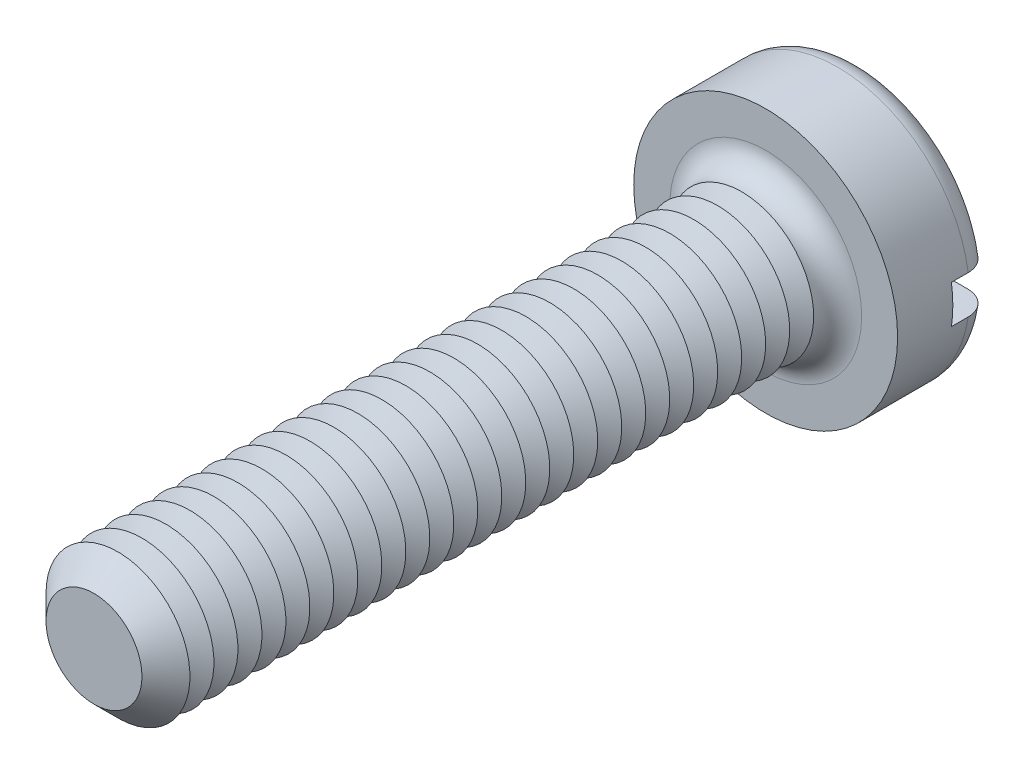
ISO-10303-21;
HEADER;
FILE_DESCRIPTION(('STEP AP214'),'2;1');
FILE_NAME('part.step','',(''),(''),'','','');
FILE_SCHEMA(('AUTOMOTIVE_DESIGN { 1 0 10303 214 1 1 1 1 }'));
ENDSEC;
DATA;
#1=APPLICATION_CONTEXT('core data for automotive mechanical design processes');
#2=APPLICATION_PROTOCOL_DEFINITION('international standard','automotive_design',2000,#1);
#3=PRODUCT_CONTEXT('',#1,'mechanical');
#4=PRODUCT('Part','Part','',(#3));
#5=PRODUCT_RELATED_PRODUCT_CATEGORY('part','',(#4));
#6=PRODUCT_DEFINITION_FORMATION('','',#4);
#7=PRODUCT_DEFINITION_CONTEXT('part definition',#1,'design');
#8=PRODUCT_DEFINITION('design','',#6,#7);
#9=PRODUCT_DEFINITION_SHAPE('','',#8);
#10=(LENGTH_UNIT() NAMED_UNIT(*) SI_UNIT(.MILLI.,.METRE.));
#11=(NAMED_UNIT(*) PLANE_ANGLE_UNIT() SI_UNIT($,.RADIAN.));
#12=(NAMED_UNIT(*) SI_UNIT($,.STERADIAN.) SOLID_ANGLE_UNIT());
#13=UNCERTAINTY_MEASURE_WITH_UNIT(LENGTH_MEASURE(1.E-05),#10,'distance_accuracy_value','');
#14=(GEOMETRIC_REPRESENTATION_CONTEXT(3) GLOBAL_UNCERTAINTY_ASSIGNED_CONTEXT((#13)) GLOBAL_UNIT_ASSIGNED_CONTEXT((#10,
#11,#12)) REPRESENTATION_CONTEXT('',''));
#15=CARTESIAN_POINT('',(0.,0.,0.));
#16=DIRECTION('',(0.,0.,1.));
#17=DIRECTION('',(1.,0.,0.));
#18=AXIS2_PLACEMENT_3D('',#15,#16,#17);
#19=CARTESIAN_POINT('',(0.,0.,-2.));
#20=DIRECTION('',(0.,0.,1.));
#21=DIRECTION('',(1.,0.,0.));
#22=AXIS2_PLACEMENT_3D('',#19,#20,#21);
#23=PLANE('',#22);
#24=CARTESIAN_POINT('',(0.,0.,-2.));
#25=DIRECTION('',(0.,0.,1.));
#26=DIRECTION('',(1.,0.,0.));
#27=AXIS2_PLACEMENT_3D('',#24,#25,#26);
#28=CIRCLE('',#27,2.25);
#29=CARTESIAN_POINT('',(-2.21415898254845,0.4,-2.));
#30=VERTEX_POINT('',#29);
#31=CARTESIAN_POINT('',(2.21415898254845,0.4,-2.));
#32=VERTEX_POINT('',#31);
#33=EDGE_CURVE('E116',#30,#32,#28,.F.);
#34=ORIENTED_EDGE('',*,*,#33,.T.);
#35=DIRECTION('',(1.,0.,0.));
#36=VECTOR('',#35,1.);
#37=CARTESIAN_POINT('',(-2.75,0.400000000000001,-2.));
#38=LINE('',#37,#36);
#39=EDGE_CURVE('E111',#30,#32,#38,.T.);
#40=ORIENTED_EDGE('',*,*,#39,.F.);
#41=EDGE_LOOP('',(#34,#40));
#42=FACE_BOUND('',#41,.T.);
#43=ADVANCED_FACE('F39',(#42),#23,.F.);
#44=CARTESIAN_POINT('',(0.,0.,-1.5));
#45=DIRECTION('',(0.,0.,1.));
#46=DIRECTION('',(1.,0.,0.));
#47=AXIS2_PLACEMENT_3D('',#44,#45,#46);
#48=TOROIDAL_SURFACE('',#47,2.25,0.5);
#49=CARTESIAN_POINT('',(-2.6296588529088,0.400000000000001,-1.78631483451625));
#50=CARTESIAN_POINT('',(-2.61332846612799,0.400000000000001,-1.80942627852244));
#51=CARTESIAN_POINT('',(-2.59501593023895,0.400000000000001,-1.83116426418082));
#52=CARTESIAN_POINT('',(-2.55497423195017,0.400000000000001,-1.87126271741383));
#53=CARTESIAN_POINT('',(-2.53324055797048,0.4,-1.88961865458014));
#54=CARTESIAN_POINT('',(-2.48702796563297,0.4,-1.92241505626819));
#55=CARTESIAN_POINT('',(-2.46255183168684,0.4,-1.93685944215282));
#56=CARTESIAN_POINT('',(-2.41154731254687,0.4,-1.96147315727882));
#57=CARTESIAN_POINT('',(-2.38501943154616,0.4,-1.97164353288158));
#58=CARTESIAN_POINT('',(-2.3303912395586,0.4,-1.98753780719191));
#59=CARTESIAN_POINT('',(-2.30227842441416,0.4,-1.99321871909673));
#60=CARTESIAN_POINT('',(-2.24549884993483,0.4,-1.99984170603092));
#61=CARTESIAN_POINT('',(-2.21683202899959,0.4,-2.00078325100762));
#62=CARTESIAN_POINT('',(-2.15939326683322,0.4,-1.99790249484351));
#63=CARTESIAN_POINT('',(-2.13062419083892,0.4,-1.99402290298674));
#64=CARTESIAN_POINT('',(-2.07413526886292,0.4,-1.98151915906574));
#65=CARTESIAN_POINT('',(-2.04641547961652,0.4,-1.97289475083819));
#66=CARTESIAN_POINT('',(-1.99264697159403,0.4,-1.95107177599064));
#67=CARTESIAN_POINT('',(-1.96660904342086,0.4,-1.93784659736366));
#68=CARTESIAN_POINT('',(-1.91713954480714,0.4,-1.90718730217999));
#69=CARTESIAN_POINT('',(-1.89370795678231,0.4,-1.88975321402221));
#70=CARTESIAN_POINT('',(-1.85029144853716,0.4,-1.85126548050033));
#71=CARTESIAN_POINT('',(-1.83028607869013,0.4,-1.83023492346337));
#72=CARTESIAN_POINT('',(-1.79417432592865,0.4,-1.78505552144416));
#73=CARTESIAN_POINT('',(-1.77806752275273,0.4,-1.76090701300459));
#74=CARTESIAN_POINT('',(-1.75056079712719,0.4,-1.71067721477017));
#75=CARTESIAN_POINT('',(-1.7390748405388,0.4,-1.68464306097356));
#76=CARTESIAN_POINT('',(-1.72075680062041,0.4,-1.63098625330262));
#77=CARTESIAN_POINT('',(-1.71392397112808,0.4,-1.60336385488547));
#78=CARTESIAN_POINT('',(-1.70525661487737,0.4,-1.54801066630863));
#79=CARTESIAN_POINT('',(-1.70330866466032,0.4,-1.52029759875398));
#80=CARTESIAN_POINT('',(-1.70414820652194,0.4,-1.46494458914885));
#81=CARTESIAN_POINT('',(-1.70693532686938,0.4,-1.43730464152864));
#82=CARTESIAN_POINT('',(-1.71709335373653,0.4,-1.38318389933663));
#83=CARTESIAN_POINT('',(-1.72441580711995,0.4,-1.35669397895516));
#84=CARTESIAN_POINT('',(-1.74335830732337,0.4,-1.30529964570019));
#85=CARTESIAN_POINT('',(-1.75497853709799,0.4,-1.2803953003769));
#86=CARTESIAN_POINT('',(-1.78229453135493,0.4,-1.23258298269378));
#87=CARTESIAN_POINT('',(-1.79803217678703,0.4,-1.20969896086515));
#88=CARTESIAN_POINT('',(-1.83304498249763,0.4,-1.16682064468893));
#89=CARTESIAN_POINT('',(-1.85232054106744,0.4,-1.1468266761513));
#90=CARTESIAN_POINT('',(-1.89433695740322,0.4,-1.10980713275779));
#91=CARTESIAN_POINT('',(-1.91714740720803,0.4,-1.09286053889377));
#92=CARTESIAN_POINT('',(-1.96524407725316,0.4,-1.06294809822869));
#93=CARTESIAN_POINT('',(-1.99053056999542,0.4,-1.04998269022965));
#94=CARTESIAN_POINT('',(-2.04340612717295,0.4,-1.02814800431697));
#95=CARTESIAN_POINT('',(-2.07103098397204,0.4,-1.01936532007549));
#96=CARTESIAN_POINT('',(-2.12735840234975,0.4,-1.00652373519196));
#97=CARTESIAN_POINT('',(-2.15606102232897,0.4,-1.00246509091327));
#98=CARTESIAN_POINT('',(-2.21395379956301,0.4,-0.999181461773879));
#99=CARTESIAN_POINT('',(-2.24314598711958,0.4,-0.999992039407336));
#100=CARTESIAN_POINT('',(-2.30097585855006,0.4,-1.00652779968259));
#101=CARTESIAN_POINT('',(-2.32961355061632,0.4,-1.01225290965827));
#102=CARTESIAN_POINT('',(-2.38536238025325,0.4,-1.02843951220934));
#103=CARTESIAN_POINT('',(-2.41248047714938,0.4,-1.03887701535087));
#104=CARTESIAN_POINT('',(-2.46454860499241,0.4,-1.06421009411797));
#105=CARTESIAN_POINT('',(-2.48949875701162,0.4,-1.0791054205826));
#106=CARTESIAN_POINT('',(-2.53620471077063,0.4,-1.11274531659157));
#107=CARTESIAN_POINT('',(-2.55799482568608,0.400000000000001,-1.1314422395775));
#108=CARTESIAN_POINT('',(-2.59807595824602,0.400000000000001,-1.17227176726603));
#109=CARTESIAN_POINT('',(-2.6163672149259,0.400000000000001,-1.19440413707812));
#110=CARTESIAN_POINT('',(-2.64868581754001,0.400000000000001,-1.24117072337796));
#111=CARTESIAN_POINT('',(-2.66276466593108,0.400000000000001,-1.26576935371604));
#112=CARTESIAN_POINT('',(-2.68654482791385,0.400000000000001,-1.31699754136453));
#113=CARTESIAN_POINT('',(-2.69624657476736,0.400000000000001,-1.34362689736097));
#114=CARTESIAN_POINT('',(-2.71090527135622,0.400000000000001,-1.39787706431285));
#115=CARTESIAN_POINT('',(-2.71590826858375,0.400000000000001,-1.4254854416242));
#116=CARTESIAN_POINT('',(-2.72118463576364,0.400000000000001,-1.48115803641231));
#117=CARTESIAN_POINT('',(-2.72145696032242,0.400000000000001,-1.50922235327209));
#118=CARTESIAN_POINT('',(-2.71727180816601,0.400000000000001,-1.56487271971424));
#119=CARTESIAN_POINT('',(-2.71283440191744,0.400000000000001,-1.59246029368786));
#120=CARTESIAN_POINT('',(-2.69939521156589,0.400000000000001,-1.64647499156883));
#121=CARTESIAN_POINT('',(-2.69039909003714,0.400000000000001,-1.67290351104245));
#122=CARTESIAN_POINT('',(-2.67251693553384,0.400000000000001,-1.71382731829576));
#123=CARTESIAN_POINT('',(-2.66497994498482,0.400000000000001,-1.72892686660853));
#124=CARTESIAN_POINT('',(-2.64841616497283,0.400000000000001,-1.75828509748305));
#125=CARTESIAN_POINT('',(-2.63938938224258,0.400000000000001,-1.77254378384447));
#126=CARTESIAN_POINT('',(-2.6296588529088,0.400000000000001,-1.78631483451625));
#127=B_SPLINE_CURVE_WITH_KNOTS('',3,(#49,#50,#51,#52,#53,#54,#55,#56,#57,#58,#59,#60,#61,#62,
#63,#64,#65,#66,#67,#68,#69,#70,#71,#72,#73,#74,#75,#76,#77,#78,#79,#80,#81,#82,#83,#84,#85,#86,
#87,#88,#89,#90,#91,#92,#93,#94,#95,#96,#97,#98,#99,#100,#101,#102,#103,#104,#105,#106,#107,
#108,#109,#110,#111,#112,#113,#114,#115,#116,#117,#118,#119,#120,#121,#122,#123,#124,#125,#126),
.UNSPECIFIED.,.T.,.F.,(4,2,2,2,2,2,2,2,2,2,2,2,2,2,2,2,2,2,2,2,2,2,2,2,2,2,2,2,2,2,2,2,2,2,2,2,
2,2,4),(0.,0.0848338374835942,0.16978050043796,0.254641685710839,0.339482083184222,
0.42512530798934,0.510778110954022,0.597458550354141,0.684143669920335,0.771338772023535,
0.858533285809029,0.945187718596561,1.03183280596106,1.11678035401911,1.20171427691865,
1.28465703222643,1.36759327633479,1.4496584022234,1.53172702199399,1.61466526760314,
1.69761285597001,1.78247103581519,1.86733856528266,1.95389396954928,2.0404540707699,
2.12764713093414,2.21483890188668,2.30159172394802,2.38833969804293,2.4740609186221,
2.55977628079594,2.6443962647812,2.72900787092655,2.81278135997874,2.89657336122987,
2.98000971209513,3.06334267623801,3.113891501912,3.16444009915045),.UNSPECIFIED.);
#128=CARTESIAN_POINT('',(-2.72075357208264,0.400000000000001,-1.50000000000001));
#129=VERTEX_POINT('',#128);
#130=EDGE_CURVE('E387',#129,#30,#127,.T.);
#131=ORIENTED_EDGE('',*,*,#130,.F.);
#132=CARTESIAN_POINT('',(0.,0.,-1.5));
#133=DIRECTION('',(0.,0.,1.));
#134=DIRECTION('',(1.,0.,0.));
#135=AXIS2_PLACEMENT_3D('',#132,#133,#134);
#136=CIRCLE('',#135,2.75);
#137=CARTESIAN_POINT('',(2.7207535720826,0.4,-1.5));
#138=VERTEX_POINT('',#137);
#139=EDGE_CURVE('E125',#138,#129,#136,.T.);
#140=ORIENTED_EDGE('',*,*,#139,.F.);
#141=CARTESIAN_POINT('',(1.7362507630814,0.4,-1.6752840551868));
#142=CARTESIAN_POINT('',(1.74636083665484,0.4,-1.70159961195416));
#143=CARTESIAN_POINT('',(1.7587429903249,0.4,-1.72706707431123));
#144=CARTESIAN_POINT('',(1.78764414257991,0.4,-1.77556609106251));
#145=CARTESIAN_POINT('',(1.80416918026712,0.4,-1.79859401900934));
#146=CARTESIAN_POINT('',(1.84080454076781,0.4,-1.84153587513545));
#147=CARTESIAN_POINT('',(1.86090949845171,0.4,-1.86145438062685));
#148=CARTESIAN_POINT('',(1.9041208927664,0.4,-1.89769607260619));
#149=CARTESIAN_POINT('',(1.92722659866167,0.4,-1.91402013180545));
#150=CARTESIAN_POINT('',(1.97620958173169,0.4,-1.94291288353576));
#151=CARTESIAN_POINT('',(2.00212726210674,0.4,-1.95541309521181));
#152=CARTESIAN_POINT('',(2.05567603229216,0.4,-1.97595143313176));
#153=CARTESIAN_POINT('',(2.08330733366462,0.4,-1.98398900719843));
#154=CARTESIAN_POINT('',(2.13989163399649,0.4,-1.99545904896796));
#155=CARTESIAN_POINT('',(2.16885726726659,0.4,-1.99882930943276));
#156=CARTESIAN_POINT('',(2.22694412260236,0.4,-2.00065872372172));
#157=CARTESIAN_POINT('',(2.25606534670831,0.4,-1.99911781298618));
#158=CARTESIAN_POINT('',(2.31362436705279,0.4,-1.99114818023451));
#159=CARTESIAN_POINT('',(2.34206235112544,0.4,-1.98472081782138));
#160=CARTESIAN_POINT('',(2.39743709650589,0.4,-1.96713601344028));
#161=CARTESIAN_POINT('',(2.42437392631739,0.4,-1.95597878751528));
#162=CARTESIAN_POINT('',(2.47569769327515,0.4,-1.92935960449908));
#163=CARTESIAN_POINT('',(2.50010686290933,0.4,-1.91394052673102));
#164=CARTESIAN_POINT('',(2.54594525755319,0.4,-1.8791725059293));
#165=CARTESIAN_POINT('',(2.56737468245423,0.4,-1.85982382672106));
#166=CARTESIAN_POINT('',(2.60634898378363,0.4,-1.81801641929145));
#167=CARTESIAN_POINT('',(2.6239407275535,0.4,-1.79560138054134));
#168=CARTESIAN_POINT('',(2.65505953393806,0.4,-1.7481077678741));
#169=CARTESIAN_POINT('',(2.66858686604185,0.4,-1.72302937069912));
#170=CARTESIAN_POINT('',(2.69103536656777,0.4,-1.67123055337));
#171=CARTESIAN_POINT('',(2.70000740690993,0.4,-1.64453217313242));
#172=CARTESIAN_POINT('',(2.71330608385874,0.4,-1.59000262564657));
#173=CARTESIAN_POINT('',(2.71763293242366,0.4,-1.5621715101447));
#174=CARTESIAN_POINT('',(2.72149675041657,0.4,-1.50637655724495));
#175=CARTESIAN_POINT('',(2.72106725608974,0.4,-1.47841503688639));
#176=CARTESIAN_POINT('',(2.7155123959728,0.4,-1.42296287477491));
#177=CARTESIAN_POINT('',(2.71038711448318,0.4,-1.39547222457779));
#178=CARTESIAN_POINT('',(2.69560462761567,0.4,-1.34178071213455));
#179=CARTESIAN_POINT('',(2.68595389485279,0.4,-1.31557806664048));
#180=CARTESIAN_POINT('',(2.66240876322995,0.4,-1.26515516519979));
#181=CARTESIAN_POINT('',(2.64851431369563,0.4,-1.24093493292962));
#182=CARTESIAN_POINT('',(2.61681930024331,0.4,-1.19504594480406));
#183=CARTESIAN_POINT('',(2.59900198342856,0.4,-1.17338876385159));
#184=CARTESIAN_POINT('',(2.56001495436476,0.4,-1.13333899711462));
#185=CARTESIAN_POINT('',(2.53884510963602,0.4,-1.11494654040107));
#186=CARTESIAN_POINT('',(2.49354554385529,0.4,-1.08175888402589));
#187=CARTESIAN_POINT('',(2.46938991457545,0.4,-1.06699905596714));
#188=CARTESIAN_POINT('',(2.41896725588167,0.4,-1.04168682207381));
#189=CARTESIAN_POINT('',(2.39270009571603,0.4,-1.03113467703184));
#190=CARTESIAN_POINT('',(2.33844927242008,0.4,-1.01439607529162));
#191=CARTESIAN_POINT('',(2.31044823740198,0.4,-1.00826592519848));
#192=CARTESIAN_POINT('',(2.25381752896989,0.4,-1.00073183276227));
#193=CARTESIAN_POINT('',(2.22518781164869,0.4,-0.999328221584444));
#194=CARTESIAN_POINT('',(2.16774231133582,0.4,-1.00127811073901));
#195=CARTESIAN_POINT('',(2.13892848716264,0.4,-1.00468955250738));
#196=CARTESIAN_POINT('',(2.08227193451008,0.4,-1.01626887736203));
#197=CARTESIAN_POINT('',(2.05442926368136,0.4,-1.02443704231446));
#198=CARTESIAN_POINT('',(2.00032604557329,0.4,-1.04537295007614));
#199=CARTESIAN_POINT('',(1.97407661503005,0.4,-1.05816944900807));
#200=CARTESIAN_POINT('',(1.92411255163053,0.4,-1.08801035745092));
#201=CARTESIAN_POINT('',(1.90039792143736,0.4,-1.10505477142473));
#202=CARTESIAN_POINT('',(1.85633574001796,0.4,-1.14282887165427));
#203=CARTESIAN_POINT('',(1.83597040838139,0.4,-1.16353779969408));
#204=CARTESIAN_POINT('',(1.79908731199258,0.4,-1.20813793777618));
#205=CARTESIAN_POINT('',(1.78256899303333,0.4,-1.23202868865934));
#206=CARTESIAN_POINT('',(1.75420022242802,0.4,-1.28183173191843));
#207=CARTESIAN_POINT('',(1.74226635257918,0.4,-1.30769648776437));
#208=CARTESIAN_POINT('',(1.72302798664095,0.4,-1.36110211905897));
#209=CARTESIAN_POINT('',(1.71572395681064,0.4,-1.38864316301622));
#210=CARTESIAN_POINT('',(1.70611974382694,0.4,-1.44392326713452));
#211=CARTESIAN_POINT('',(1.70370764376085,0.4,-1.47164298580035));
#212=CARTESIAN_POINT('',(1.70363822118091,0.4,-1.52706336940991));
#213=CARTESIAN_POINT('',(1.70597448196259,0.4,-1.55476400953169));
#214=CARTESIAN_POINT('',(1.71335146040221,0.4,-1.59796127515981));
#215=CARTESIAN_POINT('',(1.71686033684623,0.4,-1.61373520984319));
#216=CARTESIAN_POINT('',(1.7254146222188,0.4,-1.64486018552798));
#217=CARTESIAN_POINT('',(1.73045999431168,0.4,-1.66021123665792));
#218=CARTESIAN_POINT('',(1.7362507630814,0.4,-1.6752840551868));
#219=B_SPLINE_CURVE_WITH_KNOTS('',3,(#141,#142,#143,#144,#145,#146,#147,#148,#149,#150,#151,
#152,#153,#154,#155,#156,#157,#158,#159,#160,#161,#162,#163,#164,#165,#166,#167,#168,#169,#170,
#171,#172,#173,#174,#175,#176,#177,#178,#179,#180,#181,#182,#183,#184,#185,#186,#187,#188,#189,
#190,#191,#192,#193,#194,#195,#196,#197,#198,#199,#200,#201,#202,#203,#204,#205,#206,#207,#208,
#209,#210,#211,#212,#213,#214,#215,#216,#217,#218),.UNSPECIFIED.,.T.,.F.,(4,2,2,2,2,2,2,2,2,2,2,
2,2,2,2,2,2,2,2,2,2,2,2,2,2,2,2,2,2,2,2,2,2,2,2,2,2,2,4),(0.,0.0845117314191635,
0.169147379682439,0.253657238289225,0.338146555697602,0.424070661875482,0.510005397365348,
0.597074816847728,0.684145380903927,0.771191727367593,0.858234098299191,0.94443074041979,
1.03062159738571,1.11569223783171,1.20075723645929,1.28485012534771,1.36893917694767,
1.45243570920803,1.53593074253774,1.61930671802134,1.70268368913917,1.7864238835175,
1.87016738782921,1.95469664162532,2.03923113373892,2.12482389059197,2.21042264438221,
2.29706026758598,2.38370302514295,2.47089361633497,2.55808429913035,2.64479602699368,
2.73149525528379,2.81653234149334,2.9015779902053,2.98465497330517,3.06761976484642,
3.11602689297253,3.164432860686),.UNSPECIFIED.);
#220=EDGE_CURVE('E389',#32,#138,#219,.T.);
#221=ORIENTED_EDGE('',*,*,#220,.F.);
#222=ORIENTED_EDGE('',*,*,#33,.F.);
#223=EDGE_LOOP('',(#131,#140,#221,#222));
#224=FACE_BOUND('',#223,.T.);
#225=ADVANCED_FACE('F371',(#224),#48,.T.);
#226=CARTESIAN_POINT('',(0.,0.,-2.));
#227=DIRECTION('',(0.,0.,1.));
#228=DIRECTION('',(1.,0.,0.));
#229=AXIS2_PLACEMENT_3D('',#226,#227,#228);
#230=CYLINDRICAL_SURFACE('',#229,2.75);
#231=DIRECTION('',(0.,0.,1.));
#232=VECTOR('',#231,1.);
#233=CARTESIAN_POINT('',(2.72075357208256,0.4,-2.));
#234=LINE('',#233,#232);
#235=CARTESIAN_POINT('',(2.72075357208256,0.4,-1.15));
#236=VERTEX_POINT('',#235);
#237=EDGE_CURVE('E404',#138,#236,#234,.T.);
#238=ORIENTED_EDGE('',*,*,#237,.F.);
#239=ORIENTED_EDGE('',*,*,#139,.T.);
#240=DIRECTION('',(0.,0.,1.));
#241=VECTOR('',#240,1.);
#242=CARTESIAN_POINT('',(-2.72075357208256,0.4,-2.));
#243=LINE('',#242,#241);
#244=CARTESIAN_POINT('',(-2.72075357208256,0.4,-1.15));
#245=VERTEX_POINT('',#244);
#246=EDGE_CURVE('E63',#245,#129,#243,.F.);
#247=ORIENTED_EDGE('',*,*,#246,.F.);
#248=CARTESIAN_POINT('',(0.,0.,-1.15));
#249=DIRECTION('',(0.,0.,-1.));
#250=DIRECTION('',(-1.,0.,0.));
#251=AXIS2_PLACEMENT_3D('',#248,#249,#250);
#252=CIRCLE('',#251,2.75);
#253=CARTESIAN_POINT('',(-2.72075357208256,-0.4,-1.15));
#254=VERTEX_POINT('',#253);
#255=EDGE_CURVE('E43',#245,#254,#252,.F.);
#256=ORIENTED_EDGE('',*,*,#255,.T.);
#257=DIRECTION('',(0.,0.,1.));
#258=VECTOR('',#257,1.);
#259=CARTESIAN_POINT('',(-2.72075357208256,-0.4,-2.));
#260=LINE('',#259,#258);
#261=CARTESIAN_POINT('',(-2.72075357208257,-0.4,-1.5));
#262=VERTEX_POINT('',#261);
#263=EDGE_CURVE('E402',#262,#254,#260,.T.);
#264=ORIENTED_EDGE('',*,*,#263,.F.);
#265=CARTESIAN_POINT('',(2.72075357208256,-0.4,-1.5));
#266=VERTEX_POINT('',#265);
#267=EDGE_CURVE('E127',#262,#266,#136,.T.);
#268=ORIENTED_EDGE('',*,*,#267,.T.);
#269=DIRECTION('',(0.,0.,1.));
#270=VECTOR('',#269,1.);
#271=CARTESIAN_POINT('',(2.72075357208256,-0.4,-2.));
#272=LINE('',#271,#270);
#273=CARTESIAN_POINT('',(2.72075357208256,-0.4,-1.15));
#274=VERTEX_POINT('',#273);
#275=EDGE_CURVE('E55',#274,#266,#272,.F.);
#276=ORIENTED_EDGE('',*,*,#275,.F.);
#277=EDGE_CURVE('E11',#274,#236,#252,.F.);
#278=ORIENTED_EDGE('',*,*,#277,.T.);
#279=EDGE_LOOP('',(#238,#239,#247,#256,#264,#268,#276,#278));
#280=FACE_BOUND('',#279,.T.);
#281=CARTESIAN_POINT('',(0.,0.,0.));
#282=DIRECTION('',(0.,0.,1.));
#283=DIRECTION('',(1.,0.,0.));
#284=AXIS2_PLACEMENT_3D('',#281,#282,#283);
#285=CIRCLE('',#284,2.75);
#286=CARTESIAN_POINT('',(2.75,0.,0.));
#287=VERTEX_POINT('',#286);
#288=EDGE_CURVE('E407',#287,#287,#285,.T.);
#289=ORIENTED_EDGE('',*,*,#288,.F.);
#290=EDGE_LOOP('',(#289));
#291=FACE_BOUND('',#290,.T.);
#292=ADVANCED_FACE('F367',(#280,#291),#230,.T.);
#293=CARTESIAN_POINT('',(2.21415898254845,-0.4,-2.));
#294=VERTEX_POINT('',#293);
#295=CARTESIAN_POINT('',(-2.21415898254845,-0.4,-2.));
#296=VERTEX_POINT('',#295);
#297=EDGE_CURVE('E109',#294,#296,#28,.F.);
#298=ORIENTED_EDGE('',*,*,#297,.T.);
#299=DIRECTION('',(-1.,0.,0.));
#300=VECTOR('',#299,1.);
#301=CARTESIAN_POINT('',(-2.75,-0.4,-2.));
#302=LINE('',#301,#300);
#303=EDGE_CURVE('E96',#294,#296,#302,.T.);
#304=ORIENTED_EDGE('',*,*,#303,.F.);
#305=EDGE_LOOP('',(#298,#304));
#306=FACE_BOUND('',#305,.T.);
#307=ADVANCED_FACE('F108',(#306),#23,.F.);
#308=CARTESIAN_POINT('',(0.,0.,0.));
#309=DIRECTION('',(0.,0.,1.));
#310=DIRECTION('',(1.,0.,0.));
#311=AXIS2_PLACEMENT_3D('',#308,#309,#310);
#312=PLANE('',#311);
#313=CARTESIAN_POINT('',(0.,0.,0.));
#314=DIRECTION('',(0.,0.,1.));
#315=DIRECTION('',(1.,0.,0.));
#316=AXIS2_PLACEMENT_3D('',#313,#314,#315);
#317=CIRCLE('',#316,2.);
#318=CARTESIAN_POINT('',(2.,0.,0.));
#319=VERTEX_POINT('',#318);
#320=EDGE_CURVE('E115',#319,#319,#317,.F.);
#321=ORIENTED_EDGE('',*,*,#320,.T.);
#322=EDGE_LOOP('',(#321));
#323=FACE_BOUND('',#322,.T.);
#324=ORIENTED_EDGE('',*,*,#288,.T.);
#325=EDGE_LOOP('',(#324));
#326=FACE_BOUND('',#325,.T.);
#327=ADVANCED_FACE('F366',(#323,#326),#312,.T.);
#328=CARTESIAN_POINT('',(-2.6296588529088,-0.4,-1.78631483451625));
#329=CARTESIAN_POINT('',(-2.64575286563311,-0.4,-1.76353353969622));
#330=CARTESIAN_POINT('',(-2.65994473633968,-0.4,-1.73938506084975));
#331=CARTESIAN_POINT('',(-2.68408879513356,-0.4,-1.68903091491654));
#332=CARTESIAN_POINT('',(-2.69403633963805,-0.4,-1.6628230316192));
#333=CARTESIAN_POINT('',(-2.70937899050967,-0.4,-1.60911025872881));
#334=CARTESIAN_POINT('',(-2.71477511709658,-0.4,-1.5816056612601));
#335=CARTESIAN_POINT('',(-2.72085365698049,-0.4,-1.52608718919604));
#336=CARTESIAN_POINT('',(-2.7215371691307,-0.4,-1.49807343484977));
#337=CARTESIAN_POINT('',(-2.71817903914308,-0.4,-1.44242333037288));
#338=CARTESIAN_POINT('',(-2.71415291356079,-0.4,-1.41478604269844));
#339=CARTESIAN_POINT('',(-2.70152104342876,-0.4,-1.36057835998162));
#340=CARTESIAN_POINT('',(-2.69291517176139,-0.4,-1.33400799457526));
#341=CARTESIAN_POINT('',(-2.67137052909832,-0.4,-1.28266198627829));
#342=CARTESIAN_POINT('',(-2.65842829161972,-0.4,-1.25788779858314));
#343=CARTESIAN_POINT('',(-2.62859348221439,-0.4,-1.21084577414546));
#344=CARTESIAN_POINT('',(-2.61170082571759,-0.4,-1.18857799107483));
#345=CARTESIAN_POINT('',(-2.5743351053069,-0.4,-1.1470221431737));
#346=CARTESIAN_POINT('',(-2.55383974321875,-0.4,-1.12775413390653));
#347=CARTESIAN_POINT('',(-2.5099353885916,-0.4,-1.09288845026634));
#348=CARTESIAN_POINT('',(-2.48652625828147,-0.4,-1.07729094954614));
#349=CARTESIAN_POINT('',(-2.43718903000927,-0.4,-1.0500239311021));
#350=CARTESIAN_POINT('',(-2.41123629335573,-0.4,-1.0383990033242));
#351=CARTESIAN_POINT('',(-2.35776417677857,-0.4,-1.01960886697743));
#352=CARTESIAN_POINT('',(-2.33024469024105,-0.4,-1.01244396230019));
#353=CARTESIAN_POINT('',(-2.27404134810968,-0.4,-1.00268156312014));
#354=CARTESIAN_POINT('',(-2.24534705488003,-0.4,-1.00014414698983));
#355=CARTESIAN_POINT('',(-2.18793513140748,-0.4,-0.999867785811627));
#356=CARTESIAN_POINT('',(-2.15921749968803,-0.4,-1.00212917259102));
#357=CARTESIAN_POINT('',(-2.10225052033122,-0.4,-1.01142552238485));
#358=CARTESIAN_POINT('',(-2.07400941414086,-0.4,-1.01851105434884));
#359=CARTESIAN_POINT('',(-2.01911044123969,-0.4,-1.03730994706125));
#360=CARTESIAN_POINT('',(-1.99245264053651,-0.4,-1.04902350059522));
#361=CARTESIAN_POINT('',(-1.94142108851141,-0.4,-1.07679847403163));
#362=CARTESIAN_POINT('',(-1.91705303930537,-0.4,-1.09287038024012));
#363=CARTESIAN_POINT('',(-1.87139758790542,-0.4,-1.12891897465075));
#364=CARTESIAN_POINT('',(-1.85011007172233,-0.4,-1.14889551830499));
#365=CARTESIAN_POINT('',(-1.81149058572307,-0.4,-1.19196940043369));
#366=CARTESIAN_POINT('',(-1.79411779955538,-0.4,-1.21503011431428));
#367=CARTESIAN_POINT('',(-1.76359546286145,-0.4,-1.26379588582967));
#368=CARTESIAN_POINT('',(-1.75044532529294,-0.4,-1.28950057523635));
#369=CARTESIAN_POINT('',(-1.72906221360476,-0.4,-1.3422057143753));
#370=CARTESIAN_POINT('',(-1.72072512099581,-0.4,-1.3691639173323));
#371=CARTESIAN_POINT('',(-1.70880448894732,-0.4,-1.42411084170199));
#372=CARTESIAN_POINT('',(-1.7052202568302,-0.4,-1.45209941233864));
#373=CARTESIAN_POINT('',(-1.70295553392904,-0.4,-1.50768522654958));
#374=CARTESIAN_POINT('',(-1.70417398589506,-0.4,-1.53527840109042));
#375=CARTESIAN_POINT('',(-1.71124536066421,-0.4,-1.58986292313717));
#376=CARTESIAN_POINT('',(-1.71709811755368,-0.4,-1.61685429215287));
#377=CARTESIAN_POINT('',(-1.73321132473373,-0.4,-1.66938107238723));
#378=CARTESIAN_POINT('',(-1.74345625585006,-0.4,-1.69492125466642));
#379=CARTESIAN_POINT('',(-1.76802111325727,-0.4,-1.74395877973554));
#380=CARTESIAN_POINT('',(-1.78234133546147,-0.4,-1.76745597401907));
#381=CARTESIAN_POINT('',(-1.81488631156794,-0.4,-1.81216193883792));
#382=CARTESIAN_POINT('',(-1.83317116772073,-0.4,-1.83332693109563));
#383=CARTESIAN_POINT('',(-1.87296030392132,-0.4,-1.872375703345));
#384=CARTESIAN_POINT('',(-1.89446497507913,-0.4,-1.89025908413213));
#385=CARTESIAN_POINT('',(-1.94063077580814,-0.4,-1.92267732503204));
#386=CARTESIAN_POINT('',(-1.96535444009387,-0.4,-1.93712316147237));
#387=CARTESIAN_POINT('',(-2.01684705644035,-0.4,-1.96173690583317));
#388=CARTESIAN_POINT('',(-2.04361620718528,-0.4,-1.97190439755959));
#389=CARTESIAN_POINT('',(-2.09891021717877,-0.4,-1.9878230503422));
#390=CARTESIAN_POINT('',(-2.12745653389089,-0.4,-1.99349978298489));
#391=CARTESIAN_POINT('',(-2.18509639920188,-0.4,-1.99999556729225));
#392=CARTESIAN_POINT('',(-2.21418994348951,-0.4,-2.00081465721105));
#393=CARTESIAN_POINT('',(-2.27218032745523,-0.4,-1.99755156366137));
#394=CARTESIAN_POINT('',(-2.30107643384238,-0.4,-1.99345627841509));
#395=CARTESIAN_POINT('',(-2.35776697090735,-0.4,-1.98043125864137));
#396=CARTESIAN_POINT('',(-2.38556116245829,-0.4,-1.97150048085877));
#397=CARTESIAN_POINT('',(-2.43901832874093,-0.4,-1.94912081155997));
#398=CARTESIAN_POINT('',(-2.46469578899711,-0.4,-1.93570648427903));
#399=CARTESIAN_POINT('',(-2.51337022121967,-0.4,-1.90471183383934));
#400=CARTESIAN_POINT('',(-2.53637056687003,-0.4,-1.88713684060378));
#401=CARTESIAN_POINT('',(-2.57111030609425,-0.4,-1.85552084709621));
#402=CARTESIAN_POINT('',(-2.58386709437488,-0.4,-1.84257896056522));
#403=CARTESIAN_POINT('',(-2.60790410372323,-0.4,-1.81538935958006));
#404=CARTESIAN_POINT('',(-2.61918433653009,-0.4,-1.80114165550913));
#405=CARTESIAN_POINT('',(-2.6296588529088,-0.4,-1.78631483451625));
#406=B_SPLINE_CURVE_WITH_KNOTS('',3,(#328,#329,#330,#331,#332,#333,#334,#335,#336,#337,#338,
#339,#340,#341,#342,#343,#344,#345,#346,#347,#348,#349,#350,#351,#352,#353,#354,#355,#356,#357,
#358,#359,#360,#361,#362,#363,#364,#365,#366,#367,#368,#369,#370,#371,#372,#373,#374,#375,#376,
#377,#378,#379,#380,#381,#382,#383,#384,#385,#386,#387,#388,#389,#390,#391,#392,#393,#394,#395,
#396,#397,#398,#399,#400,#401,#402,#403,#404,#405),.UNSPECIFIED.,.T.,.F.,(4,2,2,2,2,2,2,2,2,2,2,
2,2,2,2,2,2,2,2,2,2,2,2,2,2,2,2,2,2,2,2,2,2,2,2,2,2,2,4),(0.,0.0836125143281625,
0.167316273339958,0.251001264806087,0.334666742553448,0.418057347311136,0.501450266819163,
0.584910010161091,0.668371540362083,0.752369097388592,0.836370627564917,0.921286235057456,
1.00620762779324,1.09222390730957,1.17824613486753,1.26518425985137,1.35212600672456,
1.43927882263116,1.52642841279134,1.61262232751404,1.69880425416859,1.7830443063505,
1.86727208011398,1.9497371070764,2.03219918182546,2.1143722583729,2.19655130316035,
2.28007615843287,2.36361116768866,2.44911836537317,2.53463387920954,2.62153862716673,
2.70844269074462,2.79557895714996,2.88273403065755,2.96923214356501,3.05562004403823,
3.11003826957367,3.16445606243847),.UNSPECIFIED.);
#407=EDGE_CURVE('E103',#296,#262,#406,.T.);
#408=ORIENTED_EDGE('',*,*,#407,.F.);
#409=ORIENTED_EDGE('',*,*,#297,.F.);
#410=CARTESIAN_POINT('',(1.7362507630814,-0.4,-1.6752840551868));
#411=CARTESIAN_POINT('',(1.72641416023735,-0.4,-1.64967314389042));
#412=CARTESIAN_POINT('',(1.71871480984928,-0.4,-1.62322216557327));
#413=CARTESIAN_POINT('',(1.70786038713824,-0.4,-1.56938399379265));
#414=CARTESIAN_POINT('',(1.70470970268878,-0.4,-1.54199592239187));
#415=CARTESIAN_POINT('',(1.70306971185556,-0.4,-1.48708393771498));
#416=CARTESIAN_POINT('',(1.70457942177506,-0.4,-1.45956005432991));
#417=CARTESIAN_POINT('',(1.71220670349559,-0.4,-1.40516538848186));
#418=CARTESIAN_POINT('',(1.71832341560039,-0.4,-1.3782944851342));
#419=CARTESIAN_POINT('',(1.73494792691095,-0.4,-1.32598312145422));
#420=CARTESIAN_POINT('',(1.74545076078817,-0.4,-1.30054108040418));
#421=CARTESIAN_POINT('',(1.77051013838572,-0.4,-1.25173932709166));
#422=CARTESIAN_POINT('',(1.7850670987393,-0.4,-1.22837982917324));
#423=CARTESIAN_POINT('',(1.81806903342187,-0.4,-1.1839775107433));
#424=CARTESIAN_POINT('',(1.8365752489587,-0.4,-1.16298023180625));
#425=CARTESIAN_POINT('',(1.87677669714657,-0.4,-1.1243010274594));
#426=CARTESIAN_POINT('',(1.89847230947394,-0.4,-1.10661949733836));
#427=CARTESIAN_POINT('',(1.94498854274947,-0.4,-1.07463966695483));
#428=CARTESIAN_POINT('',(1.96987078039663,-0.4,-1.06043095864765));
#429=CARTESIAN_POINT('',(2.02163980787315,-0.4,-1.0363161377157));
#430=CARTESIAN_POINT('',(2.04852678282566,-0.4,-1.02641042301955));
#431=CARTESIAN_POINT('',(2.10400319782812,-0.4,-1.01104128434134));
#432=CARTESIAN_POINT('',(2.13261287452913,-0.4,-1.00565079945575));
#433=CARTESIAN_POINT('',(2.19033179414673,-0.4,-0.999735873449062));
#434=CARTESIAN_POINT('',(2.2194410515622,-0.4,-0.999211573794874));
#435=CARTESIAN_POINT('',(2.27740442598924,-0.4,-1.00306591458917));
#436=CARTESIAN_POINT('',(2.30625777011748,-0.4,-1.00745623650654));
#437=CARTESIAN_POINT('',(2.36280530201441,-0.4,-1.02105937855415));
#438=CARTESIAN_POINT('',(2.39049952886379,-0.4,-1.03027203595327));
#439=CARTESIAN_POINT('',(2.44369359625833,-0.4,-1.05318710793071));
#440=CARTESIAN_POINT('',(2.46920965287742,-0.4,-1.0668518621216));
#441=CARTESIAN_POINT('',(2.51754507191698,-0.4,-1.09832423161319));
#442=CARTESIAN_POINT('',(2.54036461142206,-0.4,-1.11613157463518));
#443=CARTESIAN_POINT('',(2.58234752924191,-0.4,-1.15513986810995));
#444=CARTESIAN_POINT('',(2.601553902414,-0.4,-1.1762945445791));
#445=CARTESIAN_POINT('',(2.63609001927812,-0.4,-1.22156192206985));
#446=CARTESIAN_POINT('',(2.65142002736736,-0.4,-1.24567442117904));
#447=CARTESIAN_POINT('',(2.67757733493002,-0.4,-1.29585881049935));
#448=CARTESIAN_POINT('',(2.68845668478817,-0.4,-1.32190357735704));
#449=CARTESIAN_POINT('',(2.7056478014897,-0.4,-1.375459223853));
#450=CARTESIAN_POINT('',(2.71195980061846,-0.4,-1.40297002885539));
#451=CARTESIAN_POINT('',(2.71979288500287,-0.4,-1.45843707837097));
#452=CARTESIAN_POINT('',(2.72135241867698,-0.4,-1.48638789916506));
#453=CARTESIAN_POINT('',(2.71974298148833,-0.4,-1.54215266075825));
#454=CARTESIAN_POINT('',(2.71657412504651,-0.4,-1.56996660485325));
#455=CARTESIAN_POINT('',(2.70561779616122,-0.4,-1.62459191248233));
#456=CARTESIAN_POINT('',(2.69784258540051,-0.4,-1.65140573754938));
#457=CARTESIAN_POINT('',(2.6779146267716,-0.4,-1.70335337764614));
#458=CARTESIAN_POINT('',(2.66576185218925,-0.4,-1.72848718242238));
#459=CARTESIAN_POINT('',(2.63739107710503,-0.4,-1.77645196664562));
#460=CARTESIAN_POINT('',(2.62116029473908,-0.4,-1.79927538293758));
#461=CARTESIAN_POINT('',(2.58512700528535,-0.4,-1.84190182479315));
#462=CARTESIAN_POINT('',(2.56532438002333,-0.4,-1.86170475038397));
#463=CARTESIAN_POINT('',(2.522535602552,-0.4,-1.89791219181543));
#464=CARTESIAN_POINT('',(2.49952399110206,-0.4,-1.91428661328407));
#465=CARTESIAN_POINT('',(2.45110500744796,-0.4,-1.94299324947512));
#466=CARTESIAN_POINT('',(2.4256974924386,-0.4,-1.95532522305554));
#467=CARTESIAN_POINT('',(2.37288090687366,-0.4,-1.97575769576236));
#468=CARTESIAN_POINT('',(2.34545135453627,-0.4,-1.98380524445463));
#469=CARTESIAN_POINT('',(2.28963821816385,-0.4,-1.99524443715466));
#470=CARTESIAN_POINT('',(2.26125456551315,-0.4,-1.99863574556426));
#471=CARTESIAN_POINT('',(2.20395671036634,-0.4,-2.00070487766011));
#472=CARTESIAN_POINT('',(2.17504033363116,-0.4,-1.99932265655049));
#473=CARTESIAN_POINT('',(2.11784130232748,-0.4,-1.9917648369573));
#474=CARTESIAN_POINT('',(2.08955866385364,-0.4,-1.98558911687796));
#475=CARTESIAN_POINT('',(2.03419451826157,-0.4,-1.96854979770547));
#476=CARTESIAN_POINT('',(2.00712437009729,-0.4,-1.95764925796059));
#477=CARTESIAN_POINT('',(1.95519572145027,-0.4,-1.93144413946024));
#478=CARTESIAN_POINT('',(1.93033780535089,-0.4,-1.91613840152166));
#479=CARTESIAN_POINT('',(1.88362525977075,-0.4,-1.88157419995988));
#480=CARTESIAN_POINT('',(1.86176428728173,-0.4,-1.86232430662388));
#481=CARTESIAN_POINT('',(1.82167218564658,-0.4,-1.82038600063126));
#482=CARTESIAN_POINT('',(1.803436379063,-0.4,-1.7977020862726));
#483=CARTESIAN_POINT('',(1.77700088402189,-0.4,-1.7582526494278));
#484=CARTESIAN_POINT('',(1.7675549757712,-0.4,-1.74230781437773));
#485=CARTESIAN_POINT('',(1.75049861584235,-0.4,-1.70946415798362));
#486=CARTESIAN_POINT('',(1.7428881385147,-0.4,-1.69256534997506));
#487=CARTESIAN_POINT('',(1.7362507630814,-0.4,-1.6752840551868));
#488=B_SPLINE_CURVE_WITH_KNOTS('',3,(#410,#411,#412,#413,#414,#415,#416,#417,#418,#419,#420,
#421,#422,#423,#424,#425,#426,#427,#428,#429,#430,#431,#432,#433,#434,#435,#436,#437,#438,#439,
#440,#441,#442,#443,#444,#445,#446,#447,#448,#449,#450,#451,#452,#453,#454,#455,#456,#457,#458,
#459,#460,#461,#462,#463,#464,#465,#466,#467,#468,#469,#470,#471,#472,#473,#474,#475,#476,#477,
#478,#479,#480,#481,#482,#483,#484,#485,#486,#487),.UNSPECIFIED.,.T.,.F.,(4,2,2,2,2,2,2,2,2,2,2,
2,2,2,2,2,2,2,2,2,2,2,2,2,2,2,2,2,2,2,2,2,2,2,2,2,2,2,4),(0.,0.0822382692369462,
0.164555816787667,0.246855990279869,0.329140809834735,0.411332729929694,0.493533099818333,
0.577115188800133,0.660707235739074,0.746270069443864,0.831840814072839,0.918768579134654,
1.00569887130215,1.09283622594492,1.17997064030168,1.26638632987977,1.35279634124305,
1.43810213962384,1.52340211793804,1.60767384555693,1.69194128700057,1.77552515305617,
1.85910699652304,1.94246734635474,2.02582820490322,2.10945367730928,2.19308191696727,
2.2774160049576,2.36175512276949,2.4471137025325,2.53247843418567,2.61892083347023,
2.70536542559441,2.79249842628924,2.87965437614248,2.96662291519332,3.05347850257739,
3.10897061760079,3.16446195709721),.UNSPECIFIED.);
#489=EDGE_CURVE('E92',#266,#294,#488,.T.);
#490=ORIENTED_EDGE('',*,*,#489,.F.);
#491=ORIENTED_EDGE('',*,*,#267,.F.);
#492=EDGE_LOOP('',(#408,#409,#490,#491));
#493=FACE_BOUND('',#492,.T.);
#494=ADVANCED_FACE('F113',(#493),#48,.T.);
#495=CARTESIAN_POINT('',(0.,0.,0.5));
#496=DIRECTION('',(0.,0.,1.));
#497=DIRECTION('',(1.,0.,0.));
#498=AXIS2_PLACEMENT_3D('',#495,#496,#497);
#499=TOROIDAL_SURFACE('',#498,2.,0.5);
#500=ORIENTED_EDGE('',*,*,#320,.F.);
#501=EDGE_LOOP('',(#500));
#502=FACE_BOUND('',#501,.T.);
#503=CARTESIAN_POINT('',(0.,0.,0.5));
#504=DIRECTION('',(0.,0.,-1.));
#505=DIRECTION('',(-1.,0.,0.));
#506=AXIS2_PLACEMENT_3D('',#503,#504,#505);
#507=CIRCLE('',#506,1.5);
#508=CARTESIAN_POINT('',(-1.5,0.,0.5));
#509=VERTEX_POINT('',#508);
#510=EDGE_CURVE('E413',#509,#509,#507,.T.);
#511=ORIENTED_EDGE('',*,*,#510,.T.);
#512=EDGE_LOOP('',(#511));
#513=FACE_BOUND('',#512,.T.);
#514=ADVANCED_FACE('F359',(#502,#513),#499,.F.);
#515=CARTESIAN_POINT('',(0.,0.,0.750000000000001));
#516=DIRECTION('',(0.,0.,-1.));
#517=DIRECTION('',(-1.,0.,0.));
#518=AXIS2_PLACEMENT_3D('',#515,#516,#517);
#519=CONICAL_SURFACE('',#518,1.06698729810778,1.0471975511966);
#520=ORIENTED_EDGE('',*,*,#510,.F.);
#521=EDGE_LOOP('',(#520));
#522=FACE_BOUND('',#521,.T.);
#523=CARTESIAN_POINT('',(0.,0.,0.750000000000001));
#524=DIRECTION('',(0.,0.,-1.));
#525=DIRECTION('',(-1.,0.,0.));
#526=AXIS2_PLACEMENT_3D('',#523,#524,#525);
#527=CIRCLE('',#526,1.06698729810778);
#528=CARTESIAN_POINT('',(-1.06698729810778,0.,0.750000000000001));
#529=VERTEX_POINT('',#528);
#530=EDGE_CURVE('E420',#529,#529,#527,.T.);
#531=ORIENTED_EDGE('',*,*,#530,.T.);
#532=EDGE_LOOP('',(#531));
#533=FACE_BOUND('',#532,.T.);
#534=ADVANCED_FACE('F355',(#522,#533),#519,.T.);
#535=CARTESIAN_POINT('',(0.,0.,1.));
#536=DIRECTION('',(0.,0.,1.));
#537=DIRECTION('',(1.,0.,0.));
#538=AXIS2_PLACEMENT_3D('',#535,#536,#537);
#539=CONICAL_SURFACE('',#538,1.5,1.0471975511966);
#540=ORIENTED_EDGE('',*,*,#530,.F.);
#541=EDGE_LOOP('',(#540));
#542=FACE_BOUND('',#541,.T.);
#543=CARTESIAN_POINT('',(0.,0.,1.));
#544=DIRECTION('',(0.,0.,-1.));
#545=DIRECTION('',(-1.,0.,0.));
#546=AXIS2_PLACEMENT_3D('',#543,#544,#545);
#547=CIRCLE('',#546,1.5);
#548=CARTESIAN_POINT('',(-1.5,0.,1.));
#549=VERTEX_POINT('',#548);
#550=EDGE_CURVE('E426',#549,#549,#547,.T.);
#551=ORIENTED_EDGE('',*,*,#550,.T.);
#552=EDGE_LOOP('',(#551));
#553=FACE_BOUND('',#552,.T.);
#554=ADVANCED_FACE('F351',(#542,#553),#539,.T.);
#555=CARTESIAN_POINT('',(0.,0.,1.25));
#556=DIRECTION('',(0.,0.,-1.));
#557=DIRECTION('',(-1.,0.,0.));
#558=AXIS2_PLACEMENT_3D('',#555,#556,#557);
#559=CONICAL_SURFACE('',#558,1.06698729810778,1.0471975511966);
#560=ORIENTED_EDGE('',*,*,#550,.F.);
#561=EDGE_LOOP('',(#560));
#562=FACE_BOUND('',#561,.T.);
#563=CARTESIAN_POINT('',(0.,0.,1.25));
#564=DIRECTION('',(0.,0.,-1.));
#565=DIRECTION('',(-1.,0.,0.));
#566=AXIS2_PLACEMENT_3D('',#563,#564,#565);
#567=CIRCLE('',#566,1.06698729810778);
#568=CARTESIAN_POINT('',(-1.06698729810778,0.,1.25));
#569=VERTEX_POINT('',#568);
#570=EDGE_CURVE('E430',#569,#569,#567,.T.);
#571=ORIENTED_EDGE('',*,*,#570,.T.);
#572=EDGE_LOOP('',(#571));
#573=FACE_BOUND('',#572,.T.);
#574=ADVANCED_FACE('F347',(#562,#573),#559,.T.);
#575=CARTESIAN_POINT('',(0.,0.,1.5));
#576=DIRECTION('',(0.,0.,1.));
#577=DIRECTION('',(1.,0.,0.));
#578=AXIS2_PLACEMENT_3D('',#575,#576,#577);
#579=CONICAL_SURFACE('',#578,1.5,1.0471975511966);
#580=ORIENTED_EDGE('',*,*,#570,.F.);
#581=EDGE_LOOP('',(#580));
#582=FACE_BOUND('',#581,.T.);
#583=CARTESIAN_POINT('',(0.,0.,1.5));
#584=DIRECTION('',(0.,0.,-1.));
#585=DIRECTION('',(-1.,0.,0.));
#586=AXIS2_PLACEMENT_3D('',#583,#584,#585);
#587=CIRCLE('',#586,1.5);
#588=CARTESIAN_POINT('',(-1.5,0.,1.5));
#589=VERTEX_POINT('',#588);
#590=EDGE_CURVE('E434',#589,#589,#587,.T.);
#591=ORIENTED_EDGE('',*,*,#590,.T.);
#592=EDGE_LOOP('',(#591));
#593=FACE_BOUND('',#592,.T.);
#594=ADVANCED_FACE('F343',(#582,#593),#579,.T.);
#595=CARTESIAN_POINT('',(0.,0.,1.75));
#596=DIRECTION('',(0.,0.,-1.));
#597=DIRECTION('',(-1.,0.,0.));
#598=AXIS2_PLACEMENT_3D('',#595,#596,#597);
#599=CONICAL_SURFACE('',#598,1.06698729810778,1.0471975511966);
#600=ORIENTED_EDGE('',*,*,#590,.F.);
#601=EDGE_LOOP('',(#600));
#602=FACE_BOUND('',#601,.T.);
#603=CARTESIAN_POINT('',(0.,0.,1.75));
#604=DIRECTION('',(0.,0.,-1.));
#605=DIRECTION('',(-1.,0.,0.));
#606=AXIS2_PLACEMENT_3D('',#603,#604,#605);
#607=CIRCLE('',#606,1.06698729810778);
#608=CARTESIAN_POINT('',(-1.06698729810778,0.,1.75));
#609=VERTEX_POINT('',#608);
#610=EDGE_CURVE('E437',#609,#609,#607,.T.);
#611=ORIENTED_EDGE('',*,*,#610,.T.);
#612=EDGE_LOOP('',(#611));
#613=FACE_BOUND('',#612,.T.);
#614=ADVANCED_FACE('F339',(#602,#613),#599,.T.);
#615=CARTESIAN_POINT('',(0.,0.,2.));
#616=DIRECTION('',(0.,0.,1.));
#617=DIRECTION('',(1.,0.,0.));
#618=AXIS2_PLACEMENT_3D('',#615,#616,#617);
#619=CONICAL_SURFACE('',#618,1.5,1.0471975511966);
#620=ORIENTED_EDGE('',*,*,#610,.F.);
#621=EDGE_LOOP('',(#620));
#622=FACE_BOUND('',#621,.T.);
#623=CARTESIAN_POINT('',(0.,0.,2.));
#624=DIRECTION('',(0.,0.,-1.));
#625=DIRECTION('',(-1.,0.,0.));
#626=AXIS2_PLACEMENT_3D('',#623,#624,#625);
#627=CIRCLE('',#626,1.5);
#628=CARTESIAN_POINT('',(-1.5,0.,2.));
#629=VERTEX_POINT('',#628);
#630=EDGE_CURVE('E441',#629,#629,#627,.T.);
#631=ORIENTED_EDGE('',*,*,#630,.T.);
#632=EDGE_LOOP('',(#631));
#633=FACE_BOUND('',#632,.T.);
#634=ADVANCED_FACE('F335',(#622,#633),#619,.T.);
#635=CARTESIAN_POINT('',(0.,0.,2.25));
#636=DIRECTION('',(0.,0.,-1.));
#637=DIRECTION('',(-1.,0.,0.));
#638=AXIS2_PLACEMENT_3D('',#635,#636,#637);
#639=CONICAL_SURFACE('',#638,1.06698729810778,1.0471975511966);
#640=ORIENTED_EDGE('',*,*,#630,.F.);
#641=EDGE_LOOP('',(#640));
#642=FACE_BOUND('',#641,.T.);
#643=CARTESIAN_POINT('',(0.,0.,2.25));
#644=DIRECTION('',(0.,0.,-1.));
#645=DIRECTION('',(-1.,0.,0.));
#646=AXIS2_PLACEMENT_3D('',#643,#644,#645);
#647=CIRCLE('',#646,1.06698729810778);
#648=CARTESIAN_POINT('',(-1.06698729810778,0.,2.25));
#649=VERTEX_POINT('',#648);
#650=EDGE_CURVE('E445',#649,#649,#647,.T.);
#651=ORIENTED_EDGE('',*,*,#650,.T.);
#652=EDGE_LOOP('',(#651));
#653=FACE_BOUND('',#652,.T.);
#654=ADVANCED_FACE('F331',(#642,#653),#639,.T.);
#655=CARTESIAN_POINT('',(0.,0.,2.5));
#656=DIRECTION('',(0.,0.,1.));
#657=DIRECTION('',(1.,0.,0.));
#658=AXIS2_PLACEMENT_3D('',#655,#656,#657);
#659=CONICAL_SURFACE('',#658,1.5,1.0471975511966);
#660=ORIENTED_EDGE('',*,*,#650,.F.);
#661=EDGE_LOOP('',(#660));
#662=FACE_BOUND('',#661,.T.);
#663=CARTESIAN_POINT('',(0.,0.,2.5));
#664=DIRECTION('',(0.,0.,-1.));
#665=DIRECTION('',(-1.,0.,0.));
#666=AXIS2_PLACEMENT_3D('',#663,#664,#665);
#667=CIRCLE('',#666,1.5);
#668=CARTESIAN_POINT('',(-1.5,0.,2.5));
#669=VERTEX_POINT('',#668);
#670=EDGE_CURVE('E448',#669,#669,#667,.T.);
#671=ORIENTED_EDGE('',*,*,#670,.T.);
#672=EDGE_LOOP('',(#671));
#673=FACE_BOUND('',#672,.T.);
#674=ADVANCED_FACE('F327',(#662,#673),#659,.T.);
#675=CARTESIAN_POINT('',(0.,0.,2.75));
#676=DIRECTION('',(0.,0.,-1.));
#677=DIRECTION('',(-1.,0.,0.));
#678=AXIS2_PLACEMENT_3D('',#675,#676,#677);
#679=CONICAL_SURFACE('',#678,1.06698729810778,1.0471975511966);
#680=ORIENTED_EDGE('',*,*,#670,.F.);
#681=EDGE_LOOP('',(#680));
#682=FACE_BOUND('',#681,.T.);
#683=CARTESIAN_POINT('',(0.,0.,2.75));
#684=DIRECTION('',(0.,0.,-1.));
#685=DIRECTION('',(-1.,0.,0.));
#686=AXIS2_PLACEMENT_3D('',#683,#684,#685);
#687=CIRCLE('',#686,1.06698729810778);
#688=CARTESIAN_POINT('',(-1.06698729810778,0.,2.75));
#689=VERTEX_POINT('',#688);
#690=EDGE_CURVE('E452',#689,#689,#687,.T.);
#691=ORIENTED_EDGE('',*,*,#690,.T.);
#692=EDGE_LOOP('',(#691));
#693=FACE_BOUND('',#692,.T.);
#694=ADVANCED_FACE('F323',(#682,#693),#679,.T.);
#695=CARTESIAN_POINT('',(0.,0.,3.));
#696=DIRECTION('',(0.,0.,1.));
#697=DIRECTION('',(1.,0.,0.));
#698=AXIS2_PLACEMENT_3D('',#695,#696,#697);
#699=CONICAL_SURFACE('',#698,1.5,1.0471975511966);
#700=ORIENTED_EDGE('',*,*,#690,.F.);
#701=EDGE_LOOP('',(#700));
#702=FACE_BOUND('',#701,.T.);
#703=CARTESIAN_POINT('',(0.,0.,3.));
#704=DIRECTION('',(0.,0.,-1.));
#705=DIRECTION('',(-1.,0.,0.));
#706=AXIS2_PLACEMENT_3D('',#703,#704,#705);
#707=CIRCLE('',#706,1.5);
#708=CARTESIAN_POINT('',(-1.5,0.,3.));
#709=VERTEX_POINT('',#708);
#710=EDGE_CURVE('E456',#709,#709,#707,.T.);
#711=ORIENTED_EDGE('',*,*,#710,.T.);
#712=EDGE_LOOP('',(#711));
#713=FACE_BOUND('',#712,.T.);
#714=ADVANCED_FACE('F319',(#702,#713),#699,.T.);
#715=CARTESIAN_POINT('',(0.,0.,3.25));
#716=DIRECTION('',(0.,0.,-1.));
#717=DIRECTION('',(-1.,0.,0.));
#718=AXIS2_PLACEMENT_3D('',#715,#716,#717);
#719=CONICAL_SURFACE('',#718,1.06698729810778,1.0471975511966);
#720=ORIENTED_EDGE('',*,*,#710,.F.);
#721=EDGE_LOOP('',(#720));
#722=FACE_BOUND('',#721,.T.);
#723=CARTESIAN_POINT('',(0.,0.,3.25));
#724=DIRECTION('',(0.,0.,-1.));
#725=DIRECTION('',(-1.,0.,0.));
#726=AXIS2_PLACEMENT_3D('',#723,#724,#725);
#727=CIRCLE('',#726,1.06698729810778);
#728=CARTESIAN_POINT('',(-1.06698729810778,0.,3.25));
#729=VERTEX_POINT('',#728);
#730=EDGE_CURVE('E459',#729,#729,#727,.T.);
#731=ORIENTED_EDGE('',*,*,#730,.T.);
#732=EDGE_LOOP('',(#731));
#733=FACE_BOUND('',#732,.T.);
#734=ADVANCED_FACE('F315',(#722,#733),#719,.T.);
#735=CARTESIAN_POINT('',(0.,0.,3.5));
#736=DIRECTION('',(0.,0.,1.));
#737=DIRECTION('',(1.,0.,0.));
#738=AXIS2_PLACEMENT_3D('',#735,#736,#737);
#739=CONICAL_SURFACE('',#738,1.5,1.0471975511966);
#740=ORIENTED_EDGE('',*,*,#730,.F.);
#741=EDGE_LOOP('',(#740));
#742=FACE_BOUND('',#741,.T.);
#743=CARTESIAN_POINT('',(0.,0.,3.5));
#744=DIRECTION('',(0.,0.,-1.));
#745=DIRECTION('',(-1.,0.,0.));
#746=AXIS2_PLACEMENT_3D('',#743,#744,#745);
#747=CIRCLE('',#746,1.5);
#748=CARTESIAN_POINT('',(-1.5,0.,3.5));
#749=VERTEX_POINT('',#748);
#750=EDGE_CURVE('E463',#749,#749,#747,.T.);
#751=ORIENTED_EDGE('',*,*,#750,.T.);
#752=EDGE_LOOP('',(#751));
#753=FACE_BOUND('',#752,.T.);
#754=ADVANCED_FACE('F311',(#742,#753),#739,.T.);
#755=CARTESIAN_POINT('',(0.,0.,3.75));
#756=DIRECTION('',(0.,0.,-1.));
#757=DIRECTION('',(-1.,0.,0.));
#758=AXIS2_PLACEMENT_3D('',#755,#756,#757);
#759=CONICAL_SURFACE('',#758,1.06698729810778,1.0471975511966);
#760=ORIENTED_EDGE('',*,*,#750,.F.);
#761=EDGE_LOOP('',(#760));
#762=FACE_BOUND('',#761,.T.);
#763=CARTESIAN_POINT('',(0.,0.,3.75));
#764=DIRECTION('',(0.,0.,-1.));
#765=DIRECTION('',(-1.,0.,0.));
#766=AXIS2_PLACEMENT_3D('',#763,#764,#765);
#767=CIRCLE('',#766,1.06698729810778);
#768=CARTESIAN_POINT('',(-1.06698729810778,0.,3.75));
#769=VERTEX_POINT('',#768);
#770=EDGE_CURVE('E467',#769,#769,#767,.T.);
#771=ORIENTED_EDGE('',*,*,#770,.T.);
#772=EDGE_LOOP('',(#771));
#773=FACE_BOUND('',#772,.T.);
#774=ADVANCED_FACE('F307',(#762,#773),#759,.T.);
#775=CARTESIAN_POINT('',(0.,0.,4.));
#776=DIRECTION('',(0.,0.,1.));
#777=DIRECTION('',(1.,0.,0.));
#778=AXIS2_PLACEMENT_3D('',#775,#776,#777);
#779=CONICAL_SURFACE('',#778,1.5,1.0471975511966);
#780=ORIENTED_EDGE('',*,*,#770,.F.);
#781=EDGE_LOOP('',(#780));
#782=FACE_BOUND('',#781,.T.);
#783=CARTESIAN_POINT('',(0.,0.,4.));
#784=DIRECTION('',(0.,0.,-1.));
#785=DIRECTION('',(-1.,0.,0.));
#786=AXIS2_PLACEMENT_3D('',#783,#784,#785);
#787=CIRCLE('',#786,1.5);
#788=CARTESIAN_POINT('',(-1.5,0.,4.));
#789=VERTEX_POINT('',#788);
#790=EDGE_CURVE('E471',#789,#789,#787,.T.);
#791=ORIENTED_EDGE('',*,*,#790,.T.);
#792=EDGE_LOOP('',(#791));
#793=FACE_BOUND('',#792,.T.);
#794=ADVANCED_FACE('F303',(#782,#793),#779,.T.);
#795=CARTESIAN_POINT('',(0.,0.,4.25));
#796=DIRECTION('',(0.,0.,-1.));
#797=DIRECTION('',(-1.,0.,0.));
#798=AXIS2_PLACEMENT_3D('',#795,#796,#797);
#799=CONICAL_SURFACE('',#798,1.06698729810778,1.0471975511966);
#800=ORIENTED_EDGE('',*,*,#790,.F.);
#801=EDGE_LOOP('',(#800));
#802=FACE_BOUND('',#801,.T.);
#803=CARTESIAN_POINT('',(0.,0.,4.25));
#804=DIRECTION('',(0.,0.,-1.));
#805=DIRECTION('',(-1.,0.,0.));
#806=AXIS2_PLACEMENT_3D('',#803,#804,#805);
#807=CIRCLE('',#806,1.06698729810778);
#808=CARTESIAN_POINT('',(-1.06698729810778,0.,4.25));
#809=VERTEX_POINT('',#808);
#810=EDGE_CURVE('E475',#809,#809,#807,.T.);
#811=ORIENTED_EDGE('',*,*,#810,.T.);
#812=EDGE_LOOP('',(#811));
#813=FACE_BOUND('',#812,.T.);
#814=ADVANCED_FACE('F299',(#802,#813),#799,.T.);
#815=CARTESIAN_POINT('',(0.,0.,4.5));
#816=DIRECTION('',(0.,0.,1.));
#817=DIRECTION('',(1.,0.,0.));
#818=AXIS2_PLACEMENT_3D('',#815,#816,#817);
#819=CONICAL_SURFACE('',#818,1.5,1.0471975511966);
#820=ORIENTED_EDGE('',*,*,#810,.F.);
#821=EDGE_LOOP('',(#820));
#822=FACE_BOUND('',#821,.T.);
#823=CARTESIAN_POINT('',(0.,0.,4.5));
#824=DIRECTION('',(0.,0.,-1.));
#825=DIRECTION('',(-1.,0.,0.));
#826=AXIS2_PLACEMENT_3D('',#823,#824,#825);
#827=CIRCLE('',#826,1.5);
#828=CARTESIAN_POINT('',(-1.5,0.,4.5));
#829=VERTEX_POINT('',#828);
#830=EDGE_CURVE('E479',#829,#829,#827,.T.);
#831=ORIENTED_EDGE('',*,*,#830,.T.);
#832=EDGE_LOOP('',(#831));
#833=FACE_BOUND('',#832,.T.);
#834=ADVANCED_FACE('F295',(#822,#833),#819,.T.);
#835=CARTESIAN_POINT('',(0.,0.,4.75));
#836=DIRECTION('',(0.,0.,-1.));
#837=DIRECTION('',(-1.,0.,0.));
#838=AXIS2_PLACEMENT_3D('',#835,#836,#837);
#839=CONICAL_SURFACE('',#838,1.06698729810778,1.0471975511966);
#840=ORIENTED_EDGE('',*,*,#830,.F.);
#841=EDGE_LOOP('',(#840));
#842=FACE_BOUND('',#841,.T.);
#843=CARTESIAN_POINT('',(0.,0.,4.75));
#844=DIRECTION('',(0.,0.,-1.));
#845=DIRECTION('',(-1.,0.,0.));
#846=AXIS2_PLACEMENT_3D('',#843,#844,#845);
#847=CIRCLE('',#846,1.06698729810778);
#848=CARTESIAN_POINT('',(-1.06698729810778,0.,4.75));
#849=VERTEX_POINT('',#848);
#850=EDGE_CURVE('E483',#849,#849,#847,.T.);
#851=ORIENTED_EDGE('',*,*,#850,.T.);
#852=EDGE_LOOP('',(#851));
#853=FACE_BOUND('',#852,.T.);
#854=ADVANCED_FACE('F291',(#842,#853),#839,.T.);
#855=CARTESIAN_POINT('',(0.,0.,5.));
#856=DIRECTION('',(0.,0.,1.));
#857=DIRECTION('',(1.,0.,0.));
#858=AXIS2_PLACEMENT_3D('',#855,#856,#857);
#859=CONICAL_SURFACE('',#858,1.5,1.0471975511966);
#860=ORIENTED_EDGE('',*,*,#850,.F.);
#861=EDGE_LOOP('',(#860));
#862=FACE_BOUND('',#861,.T.);
#863=CARTESIAN_POINT('',(0.,0.,5.));
#864=DIRECTION('',(0.,0.,-1.));
#865=DIRECTION('',(-1.,0.,0.));
#866=AXIS2_PLACEMENT_3D('',#863,#864,#865);
#867=CIRCLE('',#866,1.5);
#868=CARTESIAN_POINT('',(-1.5,0.,5.));
#869=VERTEX_POINT('',#868);
#870=EDGE_CURVE('E486',#869,#869,#867,.T.);
#871=ORIENTED_EDGE('',*,*,#870,.T.);
#872=EDGE_LOOP('',(#871));
#873=FACE_BOUND('',#872,.T.);
#874=ADVANCED_FACE('F287',(#862,#873),#859,.T.);
#875=CARTESIAN_POINT('',(0.,0.,5.25));
#876=DIRECTION('',(0.,0.,-1.));
#877=DIRECTION('',(-1.,0.,0.));
#878=AXIS2_PLACEMENT_3D('',#875,#876,#877);
#879=CONICAL_SURFACE('',#878,1.06698729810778,1.0471975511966);
#880=ORIENTED_EDGE('',*,*,#870,.F.);
#881=EDGE_LOOP('',(#880));
#882=FACE_BOUND('',#881,.T.);
#883=CARTESIAN_POINT('',(0.,0.,5.25));
#884=DIRECTION('',(0.,0.,-1.));
#885=DIRECTION('',(-1.,0.,0.));
#886=AXIS2_PLACEMENT_3D('',#883,#884,#885);
#887=CIRCLE('',#886,1.06698729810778);
#888=CARTESIAN_POINT('',(-1.06698729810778,0.,5.25));
#889=VERTEX_POINT('',#888);
#890=EDGE_CURVE('E490',#889,#889,#887,.T.);
#891=ORIENTED_EDGE('',*,*,#890,.T.);
#892=EDGE_LOOP('',(#891));
#893=FACE_BOUND('',#892,.T.);
#894=ADVANCED_FACE('F283',(#882,#893),#879,.T.);
#895=CARTESIAN_POINT('',(0.,0.,5.5));
#896=DIRECTION('',(0.,0.,1.));
#897=DIRECTION('',(1.,0.,0.));
#898=AXIS2_PLACEMENT_3D('',#895,#896,#897);
#899=CONICAL_SURFACE('',#898,1.5,1.0471975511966);
#900=ORIENTED_EDGE('',*,*,#890,.F.);
#901=EDGE_LOOP('',(#900));
#902=FACE_BOUND('',#901,.T.);
#903=CARTESIAN_POINT('',(0.,0.,5.5));
#904=DIRECTION('',(0.,0.,-1.));
#905=DIRECTION('',(-1.,0.,0.));
#906=AXIS2_PLACEMENT_3D('',#903,#904,#905);
#907=CIRCLE('',#906,1.5);
#908=CARTESIAN_POINT('',(-1.5,0.,5.5));
#909=VERTEX_POINT('',#908);
#910=EDGE_CURVE('E494',#909,#909,#907,.T.);
#911=ORIENTED_EDGE('',*,*,#910,.T.);
#912=EDGE_LOOP('',(#911));
#913=FACE_BOUND('',#912,.T.);
#914=ADVANCED_FACE('F279',(#902,#913),#899,.T.);
#915=CARTESIAN_POINT('',(0.,0.,5.75));
#916=DIRECTION('',(0.,0.,-1.));
#917=DIRECTION('',(-1.,0.,0.));
#918=AXIS2_PLACEMENT_3D('',#915,#916,#917);
#919=CONICAL_SURFACE('',#918,1.06698729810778,1.0471975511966);
#920=ORIENTED_EDGE('',*,*,#910,.F.);
#921=EDGE_LOOP('',(#920));
#922=FACE_BOUND('',#921,.T.);
#923=CARTESIAN_POINT('',(0.,0.,5.75));
#924=DIRECTION('',(0.,0.,-1.));
#925=DIRECTION('',(-1.,0.,0.));
#926=AXIS2_PLACEMENT_3D('',#923,#924,#925);
#927=CIRCLE('',#926,1.06698729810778);
#928=CARTESIAN_POINT('',(-1.06698729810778,0.,5.75));
#929=VERTEX_POINT('',#928);
#930=EDGE_CURVE('E498',#929,#929,#927,.T.);
#931=ORIENTED_EDGE('',*,*,#930,.T.);
#932=EDGE_LOOP('',(#931));
#933=FACE_BOUND('',#932,.T.);
#934=ADVANCED_FACE('F275',(#922,#933),#919,.T.);
#935=CARTESIAN_POINT('',(0.,0.,6.));
#936=DIRECTION('',(0.,0.,1.));
#937=DIRECTION('',(1.,0.,0.));
#938=AXIS2_PLACEMENT_3D('',#935,#936,#937);
#939=CONICAL_SURFACE('',#938,1.5,1.0471975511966);
#940=ORIENTED_EDGE('',*,*,#930,.F.);
#941=EDGE_LOOP('',(#940));
#942=FACE_BOUND('',#941,.T.);
#943=CARTESIAN_POINT('',(0.,0.,6.));
#944=DIRECTION('',(0.,0.,-1.));
#945=DIRECTION('',(-1.,0.,0.));
#946=AXIS2_PLACEMENT_3D('',#943,#944,#945);
#947=CIRCLE('',#946,1.5);
#948=CARTESIAN_POINT('',(-1.5,0.,6.));
#949=VERTEX_POINT('',#948);
#950=EDGE_CURVE('E502',#949,#949,#947,.T.);
#951=ORIENTED_EDGE('',*,*,#950,.T.);
#952=EDGE_LOOP('',(#951));
#953=FACE_BOUND('',#952,.T.);
#954=ADVANCED_FACE('F271',(#942,#953),#939,.T.);
#955=CARTESIAN_POINT('',(0.,0.,6.25));
#956=DIRECTION('',(0.,0.,-1.));
#957=DIRECTION('',(-1.,0.,0.));
#958=AXIS2_PLACEMENT_3D('',#955,#956,#957);
#959=CONICAL_SURFACE('',#958,1.06698729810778,1.0471975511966);
#960=ORIENTED_EDGE('',*,*,#950,.F.);
#961=EDGE_LOOP('',(#960));
#962=FACE_BOUND('',#961,.T.);
#963=CARTESIAN_POINT('',(0.,0.,6.25));
#964=DIRECTION('',(0.,0.,-1.));
#965=DIRECTION('',(-1.,0.,0.));
#966=AXIS2_PLACEMENT_3D('',#963,#964,#965);
#967=CIRCLE('',#966,1.06698729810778);
#968=CARTESIAN_POINT('',(-1.06698729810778,0.,6.25));
#969=VERTEX_POINT('',#968);
#970=EDGE_CURVE('E505',#969,#969,#967,.T.);
#971=ORIENTED_EDGE('',*,*,#970,.T.);
#972=EDGE_LOOP('',(#971));
#973=FACE_BOUND('',#972,.T.);
#974=ADVANCED_FACE('F267',(#962,#973),#959,.T.);
#975=CARTESIAN_POINT('',(0.,0.,6.5));
#976=DIRECTION('',(0.,0.,1.));
#977=DIRECTION('',(1.,0.,0.));
#978=AXIS2_PLACEMENT_3D('',#975,#976,#977);
#979=CONICAL_SURFACE('',#978,1.5,1.0471975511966);
#980=ORIENTED_EDGE('',*,*,#970,.F.);
#981=EDGE_LOOP('',(#980));
#982=FACE_BOUND('',#981,.T.);
#983=CARTESIAN_POINT('',(0.,0.,6.5));
#984=DIRECTION('',(0.,0.,-1.));
#985=DIRECTION('',(-1.,0.,0.));
#986=AXIS2_PLACEMENT_3D('',#983,#984,#985);
#987=CIRCLE('',#986,1.5);
#988=CARTESIAN_POINT('',(-1.5,0.,6.5));
#989=VERTEX_POINT('',#988);
#990=EDGE_CURVE('E509',#989,#989,#987,.T.);
#991=ORIENTED_EDGE('',*,*,#990,.T.);
#992=EDGE_LOOP('',(#991));
#993=FACE_BOUND('',#992,.T.);
#994=ADVANCED_FACE('F263',(#982,#993),#979,.T.);
#995=CARTESIAN_POINT('',(0.,0.,6.75));
#996=DIRECTION('',(0.,0.,-1.));
#997=DIRECTION('',(-1.,0.,0.));
#998=AXIS2_PLACEMENT_3D('',#995,#996,#997);
#999=CONICAL_SURFACE('',#998,1.06698729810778,1.0471975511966);
#1000=ORIENTED_EDGE('',*,*,#990,.F.);
#1001=EDGE_LOOP('',(#1000));
#1002=FACE_BOUND('',#1001,.T.);
#1003=CARTESIAN_POINT('',(0.,0.,6.75));
#1004=DIRECTION('',(0.,0.,-1.));
#1005=DIRECTION('',(-1.,0.,0.));
#1006=AXIS2_PLACEMENT_3D('',#1003,#1004,#1005);
#1007=CIRCLE('',#1006,1.06698729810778);
#1008=CARTESIAN_POINT('',(-1.06698729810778,0.,6.75));
#1009=VERTEX_POINT('',#1008);
#1010=EDGE_CURVE('E513',#1009,#1009,#1007,.T.);
#1011=ORIENTED_EDGE('',*,*,#1010,.T.);
#1012=EDGE_LOOP('',(#1011));
#1013=FACE_BOUND('',#1012,.T.);
#1014=ADVANCED_FACE('F259',(#1002,#1013),#999,.T.);
#1015=CARTESIAN_POINT('',(0.,0.,7.));
#1016=DIRECTION('',(0.,0.,1.));
#1017=DIRECTION('',(1.,0.,0.));
#1018=AXIS2_PLACEMENT_3D('',#1015,#1016,#1017);
#1019=CONICAL_SURFACE('',#1018,1.5,1.0471975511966);
#1020=ORIENTED_EDGE('',*,*,#1010,.F.);
#1021=EDGE_LOOP('',(#1020));
#1022=FACE_BOUND('',#1021,.T.);
#1023=CARTESIAN_POINT('',(0.,0.,7.));
#1024=DIRECTION('',(0.,0.,-1.));
#1025=DIRECTION('',(-1.,0.,0.));
#1026=AXIS2_PLACEMENT_3D('',#1023,#1024,#1025);
#1027=CIRCLE('',#1026,1.5);
#1028=CARTESIAN_POINT('',(-1.5,0.,7.));
#1029=VERTEX_POINT('',#1028);
#1030=EDGE_CURVE('E517',#1029,#1029,#1027,.T.);
#1031=ORIENTED_EDGE('',*,*,#1030,.T.);
#1032=EDGE_LOOP('',(#1031));
#1033=FACE_BOUND('',#1032,.T.);
#1034=ADVANCED_FACE('F255',(#1022,#1033),#1019,.T.);
#1035=CARTESIAN_POINT('',(0.,0.,7.25));
#1036=DIRECTION('',(0.,0.,-1.));
#1037=DIRECTION('',(-1.,0.,0.));
#1038=AXIS2_PLACEMENT_3D('',#1035,#1036,#1037);
#1039=CONICAL_SURFACE('',#1038,1.06698729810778,1.0471975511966);
#1040=ORIENTED_EDGE('',*,*,#1030,.F.);
#1041=EDGE_LOOP('',(#1040));
#1042=FACE_BOUND('',#1041,.T.);
#1043=CARTESIAN_POINT('',(0.,0.,7.25));
#1044=DIRECTION('',(0.,0.,-1.));
#1045=DIRECTION('',(-1.,0.,0.));
#1046=AXIS2_PLACEMENT_3D('',#1043,#1044,#1045);
#1047=CIRCLE('',#1046,1.06698729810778);
#1048=CARTESIAN_POINT('',(-1.06698729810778,0.,7.25));
#1049=VERTEX_POINT('',#1048);
#1050=EDGE_CURVE('E521',#1049,#1049,#1047,.T.);
#1051=ORIENTED_EDGE('',*,*,#1050,.T.);
#1052=EDGE_LOOP('',(#1051));
#1053=FACE_BOUND('',#1052,.T.);
#1054=ADVANCED_FACE('F251',(#1042,#1053),#1039,.T.);
#1055=CARTESIAN_POINT('',(0.,0.,7.5));
#1056=DIRECTION('',(0.,0.,1.));
#1057=DIRECTION('',(1.,0.,0.));
#1058=AXIS2_PLACEMENT_3D('',#1055,#1056,#1057);
#1059=CONICAL_SURFACE('',#1058,1.5,1.0471975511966);
#1060=ORIENTED_EDGE('',*,*,#1050,.F.);
#1061=EDGE_LOOP('',(#1060));
#1062=FACE_BOUND('',#1061,.T.);
#1063=CARTESIAN_POINT('',(0.,0.,7.5));
#1064=DIRECTION('',(0.,0.,-1.));
#1065=DIRECTION('',(-1.,0.,0.));
#1066=AXIS2_PLACEMENT_3D('',#1063,#1064,#1065);
#1067=CIRCLE('',#1066,1.5);
#1068=CARTESIAN_POINT('',(-1.5,0.,7.5));
#1069=VERTEX_POINT('',#1068);
#1070=EDGE_CURVE('E525',#1069,#1069,#1067,.T.);
#1071=ORIENTED_EDGE('',*,*,#1070,.T.);
#1072=EDGE_LOOP('',(#1071));
#1073=FACE_BOUND('',#1072,.T.);
#1074=ADVANCED_FACE('F247',(#1062,#1073),#1059,.T.);
#1075=CARTESIAN_POINT('',(0.,0.,7.75));
#1076=DIRECTION('',(0.,0.,-1.));
#1077=DIRECTION('',(-1.,0.,0.));
#1078=AXIS2_PLACEMENT_3D('',#1075,#1076,#1077);
#1079=CONICAL_SURFACE('',#1078,1.06698729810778,1.0471975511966);
#1080=ORIENTED_EDGE('',*,*,#1070,.F.);
#1081=EDGE_LOOP('',(#1080));
#1082=FACE_BOUND('',#1081,.T.);
#1083=CARTESIAN_POINT('',(0.,0.,7.75));
#1084=DIRECTION('',(0.,0.,-1.));
#1085=DIRECTION('',(-1.,0.,0.));
#1086=AXIS2_PLACEMENT_3D('',#1083,#1084,#1085);
#1087=CIRCLE('',#1086,1.06698729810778);
#1088=CARTESIAN_POINT('',(-1.06698729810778,0.,7.75));
#1089=VERTEX_POINT('',#1088);
#1090=EDGE_CURVE('E529',#1089,#1089,#1087,.T.);
#1091=ORIENTED_EDGE('',*,*,#1090,.T.);
#1092=EDGE_LOOP('',(#1091));
#1093=FACE_BOUND('',#1092,.T.);
#1094=ADVANCED_FACE('F243',(#1082,#1093),#1079,.T.);
#1095=CARTESIAN_POINT('',(0.,0.,8.));
#1096=DIRECTION('',(0.,0.,1.));
#1097=DIRECTION('',(1.,0.,0.));
#1098=AXIS2_PLACEMENT_3D('',#1095,#1096,#1097);
#1099=CONICAL_SURFACE('',#1098,1.5,1.0471975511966);
#1100=ORIENTED_EDGE('',*,*,#1090,.F.);
#1101=EDGE_LOOP('',(#1100));
#1102=FACE_BOUND('',#1101,.T.);
#1103=CARTESIAN_POINT('',(0.,0.,8.));
#1104=DIRECTION('',(0.,0.,-1.));
#1105=DIRECTION('',(-1.,0.,0.));
#1106=AXIS2_PLACEMENT_3D('',#1103,#1104,#1105);
#1107=CIRCLE('',#1106,1.5);
#1108=CARTESIAN_POINT('',(-1.5,0.,8.));
#1109=VERTEX_POINT('',#1108);
#1110=EDGE_CURVE('E533',#1109,#1109,#1107,.T.);
#1111=ORIENTED_EDGE('',*,*,#1110,.T.);
#1112=EDGE_LOOP('',(#1111));
#1113=FACE_BOUND('',#1112,.T.);
#1114=ADVANCED_FACE('F239',(#1102,#1113),#1099,.T.);
#1115=CARTESIAN_POINT('',(0.,0.,8.25));
#1116=DIRECTION('',(0.,0.,-1.));
#1117=DIRECTION('',(-1.,0.,0.));
#1118=AXIS2_PLACEMENT_3D('',#1115,#1116,#1117);
#1119=CONICAL_SURFACE('',#1118,1.06698729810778,1.0471975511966);
#1120=ORIENTED_EDGE('',*,*,#1110,.F.);
#1121=EDGE_LOOP('',(#1120));
#1122=FACE_BOUND('',#1121,.T.);
#1123=CARTESIAN_POINT('',(0.,0.,8.25));
#1124=DIRECTION('',(0.,0.,-1.));
#1125=DIRECTION('',(-1.,0.,0.));
#1126=AXIS2_PLACEMENT_3D('',#1123,#1124,#1125);
#1127=CIRCLE('',#1126,1.06698729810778);
#1128=CARTESIAN_POINT('',(-1.06698729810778,0.,8.25));
#1129=VERTEX_POINT('',#1128);
#1130=EDGE_CURVE('E537',#1129,#1129,#1127,.T.);
#1131=ORIENTED_EDGE('',*,*,#1130,.T.);
#1132=EDGE_LOOP('',(#1131));
#1133=FACE_BOUND('',#1132,.T.);
#1134=ADVANCED_FACE('F235',(#1122,#1133),#1119,.T.);
#1135=CARTESIAN_POINT('',(0.,0.,8.5));
#1136=DIRECTION('',(0.,0.,1.));
#1137=DIRECTION('',(1.,0.,0.));
#1138=AXIS2_PLACEMENT_3D('',#1135,#1136,#1137);
#1139=CONICAL_SURFACE('',#1138,1.5,1.0471975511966);
#1140=ORIENTED_EDGE('',*,*,#1130,.F.);
#1141=EDGE_LOOP('',(#1140));
#1142=FACE_BOUND('',#1141,.T.);
#1143=CARTESIAN_POINT('',(0.,0.,8.5));
#1144=DIRECTION('',(0.,0.,-1.));
#1145=DIRECTION('',(-1.,0.,0.));
#1146=AXIS2_PLACEMENT_3D('',#1143,#1144,#1145);
#1147=CIRCLE('',#1146,1.5);
#1148=CARTESIAN_POINT('',(-1.5,0.,8.5));
#1149=VERTEX_POINT('',#1148);
#1150=EDGE_CURVE('E541',#1149,#1149,#1147,.T.);
#1151=ORIENTED_EDGE('',*,*,#1150,.T.);
#1152=EDGE_LOOP('',(#1151));
#1153=FACE_BOUND('',#1152,.T.);
#1154=ADVANCED_FACE('F231',(#1142,#1153),#1139,.T.);
#1155=CARTESIAN_POINT('',(0.,0.,8.75));
#1156=DIRECTION('',(0.,0.,-1.));
#1157=DIRECTION('',(-1.,0.,0.));
#1158=AXIS2_PLACEMENT_3D('',#1155,#1156,#1157);
#1159=CONICAL_SURFACE('',#1158,1.06698729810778,1.0471975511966);
#1160=ORIENTED_EDGE('',*,*,#1150,.F.);
#1161=EDGE_LOOP('',(#1160));
#1162=FACE_BOUND('',#1161,.T.);
#1163=CARTESIAN_POINT('',(0.,0.,8.75));
#1164=DIRECTION('',(0.,0.,-1.));
#1165=DIRECTION('',(-1.,0.,0.));
#1166=AXIS2_PLACEMENT_3D('',#1163,#1164,#1165);
#1167=CIRCLE('',#1166,1.06698729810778);
#1168=CARTESIAN_POINT('',(-1.06698729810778,0.,8.75));
#1169=VERTEX_POINT('',#1168);
#1170=EDGE_CURVE('E545',#1169,#1169,#1167,.T.);
#1171=ORIENTED_EDGE('',*,*,#1170,.T.);
#1172=EDGE_LOOP('',(#1171));
#1173=FACE_BOUND('',#1172,.T.);
#1174=ADVANCED_FACE('F227',(#1162,#1173),#1159,.T.);
#1175=CARTESIAN_POINT('',(0.,0.,9.));
#1176=DIRECTION('',(0.,0.,1.));
#1177=DIRECTION('',(1.,0.,0.));
#1178=AXIS2_PLACEMENT_3D('',#1175,#1176,#1177);
#1179=CONICAL_SURFACE('',#1178,1.5,1.0471975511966);
#1180=ORIENTED_EDGE('',*,*,#1170,.F.);
#1181=EDGE_LOOP('',(#1180));
#1182=FACE_BOUND('',#1181,.T.);
#1183=CARTESIAN_POINT('',(0.,0.,9.));
#1184=DIRECTION('',(0.,0.,-1.));
#1185=DIRECTION('',(-1.,0.,0.));
#1186=AXIS2_PLACEMENT_3D('',#1183,#1184,#1185);
#1187=CIRCLE('',#1186,1.5);
#1188=CARTESIAN_POINT('',(-1.5,0.,9.));
#1189=VERTEX_POINT('',#1188);
#1190=EDGE_CURVE('E549',#1189,#1189,#1187,.T.);
#1191=ORIENTED_EDGE('',*,*,#1190,.T.);
#1192=EDGE_LOOP('',(#1191));
#1193=FACE_BOUND('',#1192,.T.);
#1194=ADVANCED_FACE('F223',(#1182,#1193),#1179,.T.);
#1195=CARTESIAN_POINT('',(0.,0.,9.25));
#1196=DIRECTION('',(0.,0.,-1.));
#1197=DIRECTION('',(-1.,0.,0.));
#1198=AXIS2_PLACEMENT_3D('',#1195,#1196,#1197);
#1199=CONICAL_SURFACE('',#1198,1.06698729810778,1.0471975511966);
#1200=ORIENTED_EDGE('',*,*,#1190,.F.);
#1201=EDGE_LOOP('',(#1200));
#1202=FACE_BOUND('',#1201,.T.);
#1203=CARTESIAN_POINT('',(0.,0.,9.25));
#1204=DIRECTION('',(0.,0.,-1.));
#1205=DIRECTION('',(-1.,0.,0.));
#1206=AXIS2_PLACEMENT_3D('',#1203,#1204,#1205);
#1207=CIRCLE('',#1206,1.06698729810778);
#1208=CARTESIAN_POINT('',(-1.06698729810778,0.,9.25));
#1209=VERTEX_POINT('',#1208);
#1210=EDGE_CURVE('E553',#1209,#1209,#1207,.T.);
#1211=ORIENTED_EDGE('',*,*,#1210,.T.);
#1212=EDGE_LOOP('',(#1211));
#1213=FACE_BOUND('',#1212,.T.);
#1214=ADVANCED_FACE('F219',(#1202,#1213),#1199,.T.);
#1215=CARTESIAN_POINT('',(0.,0.,9.5));
#1216=DIRECTION('',(0.,0.,1.));
#1217=DIRECTION('',(1.,0.,0.));
#1218=AXIS2_PLACEMENT_3D('',#1215,#1216,#1217);
#1219=CONICAL_SURFACE('',#1218,1.5,1.0471975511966);
#1220=ORIENTED_EDGE('',*,*,#1210,.F.);
#1221=EDGE_LOOP('',(#1220));
#1222=FACE_BOUND('',#1221,.T.);
#1223=CARTESIAN_POINT('',(0.,0.,9.5));
#1224=DIRECTION('',(0.,0.,-1.));
#1225=DIRECTION('',(-1.,0.,0.));
#1226=AXIS2_PLACEMENT_3D('',#1223,#1224,#1225);
#1227=CIRCLE('',#1226,1.5);
#1228=CARTESIAN_POINT('',(-1.5,0.,9.5));
#1229=VERTEX_POINT('',#1228);
#1230=EDGE_CURVE('E557',#1229,#1229,#1227,.T.);
#1231=ORIENTED_EDGE('',*,*,#1230,.T.);
#1232=EDGE_LOOP('',(#1231));
#1233=FACE_BOUND('',#1232,.T.);
#1234=ADVANCED_FACE('F215',(#1222,#1233),#1219,.T.);
#1235=CARTESIAN_POINT('',(0.,0.,9.75));
#1236=DIRECTION('',(0.,0.,-1.));
#1237=DIRECTION('',(-1.,0.,0.));
#1238=AXIS2_PLACEMENT_3D('',#1235,#1236,#1237);
#1239=CONICAL_SURFACE('',#1238,1.06698729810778,1.0471975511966);
#1240=ORIENTED_EDGE('',*,*,#1230,.F.);
#1241=EDGE_LOOP('',(#1240));
#1242=FACE_BOUND('',#1241,.T.);
#1243=CARTESIAN_POINT('',(0.,0.,9.75));
#1244=DIRECTION('',(0.,0.,-1.));
#1245=DIRECTION('',(-1.,0.,0.));
#1246=AXIS2_PLACEMENT_3D('',#1243,#1244,#1245);
#1247=CIRCLE('',#1246,1.06698729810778);
#1248=CARTESIAN_POINT('',(-1.06698729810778,0.,9.75));
#1249=VERTEX_POINT('',#1248);
#1250=EDGE_CURVE('E561',#1249,#1249,#1247,.T.);
#1251=ORIENTED_EDGE('',*,*,#1250,.T.);
#1252=EDGE_LOOP('',(#1251));
#1253=FACE_BOUND('',#1252,.T.);
#1254=ADVANCED_FACE('F211',(#1242,#1253),#1239,.T.);
#1255=CARTESIAN_POINT('',(0.,0.,10.));
#1256=DIRECTION('',(0.,0.,1.));
#1257=DIRECTION('',(1.,0.,0.));
#1258=AXIS2_PLACEMENT_3D('',#1255,#1256,#1257);
#1259=CONICAL_SURFACE('',#1258,1.5,1.0471975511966);
#1260=ORIENTED_EDGE('',*,*,#1250,.F.);
#1261=EDGE_LOOP('',(#1260));
#1262=FACE_BOUND('',#1261,.T.);
#1263=CARTESIAN_POINT('',(0.,0.,10.));
#1264=DIRECTION('',(0.,0.,-1.));
#1265=DIRECTION('',(-1.,0.,0.));
#1266=AXIS2_PLACEMENT_3D('',#1263,#1264,#1265);
#1267=CIRCLE('',#1266,1.5);
#1268=CARTESIAN_POINT('',(-1.5,0.,10.));
#1269=VERTEX_POINT('',#1268);
#1270=EDGE_CURVE('E564',#1269,#1269,#1267,.T.);
#1271=ORIENTED_EDGE('',*,*,#1270,.T.);
#1272=EDGE_LOOP('',(#1271));
#1273=FACE_BOUND('',#1272,.T.);
#1274=ADVANCED_FACE('F207',(#1262,#1273),#1259,.T.);
#1275=CARTESIAN_POINT('',(0.,0.,10.25));
#1276=DIRECTION('',(0.,0.,-1.));
#1277=DIRECTION('',(-1.,0.,0.));
#1278=AXIS2_PLACEMENT_3D('',#1275,#1276,#1277);
#1279=CONICAL_SURFACE('',#1278,1.06698729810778,1.0471975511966);
#1280=ORIENTED_EDGE('',*,*,#1270,.F.);
#1281=EDGE_LOOP('',(#1280));
#1282=FACE_BOUND('',#1281,.T.);
#1283=CARTESIAN_POINT('',(0.,0.,10.25));
#1284=DIRECTION('',(0.,0.,-1.));
#1285=DIRECTION('',(-1.,0.,0.));
#1286=AXIS2_PLACEMENT_3D('',#1283,#1284,#1285);
#1287=CIRCLE('',#1286,1.06698729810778);
#1288=CARTESIAN_POINT('',(-1.06698729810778,0.,10.25));
#1289=VERTEX_POINT('',#1288);
#1290=EDGE_CURVE('E568',#1289,#1289,#1287,.T.);
#1291=ORIENTED_EDGE('',*,*,#1290,.T.);
#1292=EDGE_LOOP('',(#1291));
#1293=FACE_BOUND('',#1292,.T.);
#1294=ADVANCED_FACE('F203',(#1282,#1293),#1279,.T.);
#1295=CARTESIAN_POINT('',(0.,0.,10.5));
#1296=DIRECTION('',(0.,0.,1.));
#1297=DIRECTION('',(1.,0.,0.));
#1298=AXIS2_PLACEMENT_3D('',#1295,#1296,#1297);
#1299=CONICAL_SURFACE('',#1298,1.5,1.0471975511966);
#1300=ORIENTED_EDGE('',*,*,#1290,.F.);
#1301=EDGE_LOOP('',(#1300));
#1302=FACE_BOUND('',#1301,.T.);
#1303=CARTESIAN_POINT('',(0.,0.,10.5));
#1304=DIRECTION('',(0.,0.,-1.));
#1305=DIRECTION('',(-1.,0.,0.));
#1306=AXIS2_PLACEMENT_3D('',#1303,#1304,#1305);
#1307=CIRCLE('',#1306,1.5);
#1308=CARTESIAN_POINT('',(-1.5,0.,10.5));
#1309=VERTEX_POINT('',#1308);
#1310=EDGE_CURVE('E572',#1309,#1309,#1307,.T.);
#1311=ORIENTED_EDGE('',*,*,#1310,.T.);
#1312=EDGE_LOOP('',(#1311));
#1313=FACE_BOUND('',#1312,.T.);
#1314=ADVANCED_FACE('F199',(#1302,#1313),#1299,.T.);
#1315=CARTESIAN_POINT('',(0.,0.,10.75));
#1316=DIRECTION('',(0.,0.,-1.));
#1317=DIRECTION('',(-1.,0.,0.));
#1318=AXIS2_PLACEMENT_3D('',#1315,#1316,#1317);
#1319=CONICAL_SURFACE('',#1318,1.06698729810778,1.0471975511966);
#1320=ORIENTED_EDGE('',*,*,#1310,.F.);
#1321=EDGE_LOOP('',(#1320));
#1322=FACE_BOUND('',#1321,.T.);
#1323=CARTESIAN_POINT('',(0.,0.,10.75));
#1324=DIRECTION('',(0.,0.,-1.));
#1325=DIRECTION('',(-1.,0.,0.));
#1326=AXIS2_PLACEMENT_3D('',#1323,#1324,#1325);
#1327=CIRCLE('',#1326,1.06698729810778);
#1328=CARTESIAN_POINT('',(-1.06698729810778,0.,10.75));
#1329=VERTEX_POINT('',#1328);
#1330=EDGE_CURVE('E576',#1329,#1329,#1327,.T.);
#1331=ORIENTED_EDGE('',*,*,#1330,.T.);
#1332=EDGE_LOOP('',(#1331));
#1333=FACE_BOUND('',#1332,.T.);
#1334=ADVANCED_FACE('F195',(#1322,#1333),#1319,.T.);
#1335=CARTESIAN_POINT('',(0.,0.,11.));
#1336=DIRECTION('',(0.,0.,1.));
#1337=DIRECTION('',(1.,0.,0.));
#1338=AXIS2_PLACEMENT_3D('',#1335,#1336,#1337);
#1339=CONICAL_SURFACE('',#1338,1.5,1.0471975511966);
#1340=ORIENTED_EDGE('',*,*,#1330,.F.);
#1341=EDGE_LOOP('',(#1340));
#1342=FACE_BOUND('',#1341,.T.);
#1343=CARTESIAN_POINT('',(0.,0.,11.));
#1344=DIRECTION('',(0.,0.,-1.));
#1345=DIRECTION('',(-1.,0.,0.));
#1346=AXIS2_PLACEMENT_3D('',#1343,#1344,#1345);
#1347=CIRCLE('',#1346,1.5);
#1348=CARTESIAN_POINT('',(-1.5,0.,11.));
#1349=VERTEX_POINT('',#1348);
#1350=EDGE_CURVE('E580',#1349,#1349,#1347,.T.);
#1351=ORIENTED_EDGE('',*,*,#1350,.T.);
#1352=EDGE_LOOP('',(#1351));
#1353=FACE_BOUND('',#1352,.T.);
#1354=ADVANCED_FACE('F191',(#1342,#1353),#1339,.T.);
#1355=CARTESIAN_POINT('',(0.,0.,11.25));
#1356=DIRECTION('',(0.,0.,-1.));
#1357=DIRECTION('',(-1.,0.,0.));
#1358=AXIS2_PLACEMENT_3D('',#1355,#1356,#1357);
#1359=CONICAL_SURFACE('',#1358,1.06698729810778,1.0471975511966);
#1360=ORIENTED_EDGE('',*,*,#1350,.F.);
#1361=EDGE_LOOP('',(#1360));
#1362=FACE_BOUND('',#1361,.T.);
#1363=CARTESIAN_POINT('',(0.,0.,11.25));
#1364=DIRECTION('',(0.,0.,-1.));
#1365=DIRECTION('',(-1.,0.,0.));
#1366=AXIS2_PLACEMENT_3D('',#1363,#1364,#1365);
#1367=CIRCLE('',#1366,1.06698729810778);
#1368=CARTESIAN_POINT('',(-1.06698729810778,0.,11.25));
#1369=VERTEX_POINT('',#1368);
#1370=EDGE_CURVE('E584',#1369,#1369,#1367,.T.);
#1371=ORIENTED_EDGE('',*,*,#1370,.T.);
#1372=EDGE_LOOP('',(#1371));
#1373=FACE_BOUND('',#1372,.T.);
#1374=ADVANCED_FACE('F187',(#1362,#1373),#1359,.T.);
#1375=CARTESIAN_POINT('',(0.,0.,11.5));
#1376=DIRECTION('',(0.,0.,1.));
#1377=DIRECTION('',(1.,0.,0.));
#1378=AXIS2_PLACEMENT_3D('',#1375,#1376,#1377);
#1379=CONICAL_SURFACE('',#1378,1.5,1.0471975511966);
#1380=ORIENTED_EDGE('',*,*,#1370,.F.);
#1381=EDGE_LOOP('',(#1380));
#1382=FACE_BOUND('',#1381,.T.);
#1383=CARTESIAN_POINT('',(0.,0.,11.5));
#1384=DIRECTION('',(0.,0.,-1.));
#1385=DIRECTION('',(-1.,0.,0.));
#1386=AXIS2_PLACEMENT_3D('',#1383,#1384,#1385);
#1387=CIRCLE('',#1386,1.5);
#1388=CARTESIAN_POINT('',(-1.5,0.,11.5));
#1389=VERTEX_POINT('',#1388);
#1390=EDGE_CURVE('E588',#1389,#1389,#1387,.T.);
#1391=ORIENTED_EDGE('',*,*,#1390,.T.);
#1392=EDGE_LOOP('',(#1391));
#1393=FACE_BOUND('',#1392,.T.);
#1394=ADVANCED_FACE('F183',(#1382,#1393),#1379,.T.);
#1395=CARTESIAN_POINT('',(0.,0.,11.75));
#1396=DIRECTION('',(0.,0.,-1.));
#1397=DIRECTION('',(-1.,0.,0.));
#1398=AXIS2_PLACEMENT_3D('',#1395,#1396,#1397);
#1399=CONICAL_SURFACE('',#1398,1.06698729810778,1.0471975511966);
#1400=ORIENTED_EDGE('',*,*,#1390,.F.);
#1401=EDGE_LOOP('',(#1400));
#1402=FACE_BOUND('',#1401,.T.);
#1403=CARTESIAN_POINT('',(0.,0.,11.75));
#1404=DIRECTION('',(0.,0.,-1.));
#1405=DIRECTION('',(-1.,0.,0.));
#1406=AXIS2_PLACEMENT_3D('',#1403,#1404,#1405);
#1407=CIRCLE('',#1406,1.06698729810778);
#1408=CARTESIAN_POINT('',(-1.06698729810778,0.,11.75));
#1409=VERTEX_POINT('',#1408);
#1410=EDGE_CURVE('E592',#1409,#1409,#1407,.T.);
#1411=ORIENTED_EDGE('',*,*,#1410,.T.);
#1412=EDGE_LOOP('',(#1411));
#1413=FACE_BOUND('',#1412,.T.);
#1414=ADVANCED_FACE('F179',(#1402,#1413),#1399,.T.);
#1415=CARTESIAN_POINT('',(0.,0.,12.));
#1416=DIRECTION('',(0.,0.,1.));
#1417=DIRECTION('',(1.,0.,0.));
#1418=AXIS2_PLACEMENT_3D('',#1415,#1416,#1417);
#1419=CONICAL_SURFACE('',#1418,1.5,1.0471975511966);
#1420=ORIENTED_EDGE('',*,*,#1410,.F.);
#1421=EDGE_LOOP('',(#1420));
#1422=FACE_BOUND('',#1421,.T.);
#1423=CARTESIAN_POINT('',(0.,0.,12.));
#1424=DIRECTION('',(0.,0.,-1.));
#1425=DIRECTION('',(-1.,0.,0.));
#1426=AXIS2_PLACEMENT_3D('',#1423,#1424,#1425);
#1427=CIRCLE('',#1426,1.5);
#1428=CARTESIAN_POINT('',(-1.5,0.,12.));
#1429=VERTEX_POINT('',#1428);
#1430=EDGE_CURVE('E595',#1429,#1429,#1427,.T.);
#1431=ORIENTED_EDGE('',*,*,#1430,.T.);
#1432=EDGE_LOOP('',(#1431));
#1433=FACE_BOUND('',#1432,.T.);
#1434=ADVANCED_FACE('F175',(#1422,#1433),#1419,.T.);
#1435=CARTESIAN_POINT('',(0.,0.,12.25));
#1436=DIRECTION('',(0.,0.,-1.));
#1437=DIRECTION('',(-1.,0.,0.));
#1438=AXIS2_PLACEMENT_3D('',#1435,#1436,#1437);
#1439=CONICAL_SURFACE('',#1438,1.06698729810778,1.0471975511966);
#1440=ORIENTED_EDGE('',*,*,#1430,.F.);
#1441=EDGE_LOOP('',(#1440));
#1442=FACE_BOUND('',#1441,.T.);
#1443=CARTESIAN_POINT('',(0.,0.,12.25));
#1444=DIRECTION('',(0.,0.,-1.));
#1445=DIRECTION('',(-1.,0.,0.));
#1446=AXIS2_PLACEMENT_3D('',#1443,#1444,#1445);
#1447=CIRCLE('',#1446,1.06698729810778);
#1448=CARTESIAN_POINT('',(-1.06698729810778,0.,12.25));
#1449=VERTEX_POINT('',#1448);
#1450=EDGE_CURVE('E599',#1449,#1449,#1447,.T.);
#1451=ORIENTED_EDGE('',*,*,#1450,.T.);
#1452=EDGE_LOOP('',(#1451));
#1453=FACE_BOUND('',#1452,.T.);
#1454=ADVANCED_FACE('F171',(#1442,#1453),#1439,.T.);
#1455=CARTESIAN_POINT('',(0.,0.,12.5));
#1456=DIRECTION('',(0.,0.,1.));
#1457=DIRECTION('',(1.,0.,0.));
#1458=AXIS2_PLACEMENT_3D('',#1455,#1456,#1457);
#1459=CONICAL_SURFACE('',#1458,1.5,1.0471975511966);
#1460=ORIENTED_EDGE('',*,*,#1450,.F.);
#1461=EDGE_LOOP('',(#1460));
#1462=FACE_BOUND('',#1461,.T.);
#1463=CARTESIAN_POINT('',(0.,0.,12.5));
#1464=DIRECTION('',(0.,0.,-1.));
#1465=DIRECTION('',(-1.,0.,0.));
#1466=AXIS2_PLACEMENT_3D('',#1463,#1464,#1465);
#1467=CIRCLE('',#1466,1.5);
#1468=CARTESIAN_POINT('',(-1.5,0.,12.5));
#1469=VERTEX_POINT('',#1468);
#1470=EDGE_CURVE('E603',#1469,#1469,#1467,.T.);
#1471=ORIENTED_EDGE('',*,*,#1470,.T.);
#1472=EDGE_LOOP('',(#1471));
#1473=FACE_BOUND('',#1472,.T.);
#1474=ADVANCED_FACE('F167',(#1462,#1473),#1459,.T.);
#1475=CARTESIAN_POINT('',(0.,0.,12.75));
#1476=DIRECTION('',(0.,0.,-1.));
#1477=DIRECTION('',(-1.,0.,0.));
#1478=AXIS2_PLACEMENT_3D('',#1475,#1476,#1477);
#1479=CONICAL_SURFACE('',#1478,1.06698729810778,1.0471975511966);
#1480=ORIENTED_EDGE('',*,*,#1470,.F.);
#1481=EDGE_LOOP('',(#1480));
#1482=FACE_BOUND('',#1481,.T.);
#1483=CARTESIAN_POINT('',(0.,0.,12.75));
#1484=DIRECTION('',(0.,0.,-1.));
#1485=DIRECTION('',(-1.,0.,0.));
#1486=AXIS2_PLACEMENT_3D('',#1483,#1484,#1485);
#1487=CIRCLE('',#1486,1.06698729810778);
#1488=CARTESIAN_POINT('',(-1.06698729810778,0.,12.75));
#1489=VERTEX_POINT('',#1488);
#1490=EDGE_CURVE('E607',#1489,#1489,#1487,.T.);
#1491=ORIENTED_EDGE('',*,*,#1490,.T.);
#1492=EDGE_LOOP('',(#1491));
#1493=FACE_BOUND('',#1492,.T.);
#1494=ADVANCED_FACE('F163',(#1482,#1493),#1479,.T.);
#1495=CARTESIAN_POINT('',(0.,0.,13.));
#1496=DIRECTION('',(0.,0.,1.));
#1497=DIRECTION('',(1.,0.,0.));
#1498=AXIS2_PLACEMENT_3D('',#1495,#1496,#1497);
#1499=CONICAL_SURFACE('',#1498,1.5,1.0471975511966);
#1500=ORIENTED_EDGE('',*,*,#1490,.F.);
#1501=EDGE_LOOP('',(#1500));
#1502=FACE_BOUND('',#1501,.T.);
#1503=CARTESIAN_POINT('',(0.,0.,13.));
#1504=DIRECTION('',(0.,0.,-1.));
#1505=DIRECTION('',(-1.,0.,0.));
#1506=AXIS2_PLACEMENT_3D('',#1503,#1504,#1505);
#1507=CIRCLE('',#1506,1.5);
#1508=CARTESIAN_POINT('',(-1.5,0.,13.));
#1509=VERTEX_POINT('',#1508);
#1510=EDGE_CURVE('E610',#1509,#1509,#1507,.T.);
#1511=ORIENTED_EDGE('',*,*,#1510,.T.);
#1512=EDGE_LOOP('',(#1511));
#1513=FACE_BOUND('',#1512,.T.);
#1514=ADVANCED_FACE('F159',(#1502,#1513),#1499,.T.);
#1515=CARTESIAN_POINT('',(0.,0.,13.25));
#1516=DIRECTION('',(0.,0.,-1.));
#1517=DIRECTION('',(-1.,0.,0.));
#1518=AXIS2_PLACEMENT_3D('',#1515,#1516,#1517);
#1519=CONICAL_SURFACE('',#1518,1.06698729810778,1.0471975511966);
#1520=ORIENTED_EDGE('',*,*,#1510,.F.);
#1521=EDGE_LOOP('',(#1520));
#1522=FACE_BOUND('',#1521,.T.);
#1523=CARTESIAN_POINT('',(0.,0.,13.25));
#1524=DIRECTION('',(0.,0.,-1.));
#1525=DIRECTION('',(-1.,0.,0.));
#1526=AXIS2_PLACEMENT_3D('',#1523,#1524,#1525);
#1527=CIRCLE('',#1526,1.06698729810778);
#1528=CARTESIAN_POINT('',(-1.06698729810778,0.,13.25));
#1529=VERTEX_POINT('',#1528);
#1530=EDGE_CURVE('E614',#1529,#1529,#1527,.T.);
#1531=ORIENTED_EDGE('',*,*,#1530,.T.);
#1532=EDGE_LOOP('',(#1531));
#1533=FACE_BOUND('',#1532,.T.);
#1534=ADVANCED_FACE('F155',(#1522,#1533),#1519,.T.);
#1535=CARTESIAN_POINT('',(0.,0.,13.5));
#1536=DIRECTION('',(0.,0.,1.));
#1537=DIRECTION('',(1.,0.,0.));
#1538=AXIS2_PLACEMENT_3D('',#1535,#1536,#1537);
#1539=CONICAL_SURFACE('',#1538,1.5,1.0471975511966);
#1540=ORIENTED_EDGE('',*,*,#1530,.F.);
#1541=EDGE_LOOP('',(#1540));
#1542=FACE_BOUND('',#1541,.T.);
#1543=CARTESIAN_POINT('',(0.,0.,13.5));
#1544=DIRECTION('',(0.,0.,-1.));
#1545=DIRECTION('',(-1.,0.,0.));
#1546=AXIS2_PLACEMENT_3D('',#1543,#1544,#1545);
#1547=CIRCLE('',#1546,1.5);
#1548=CARTESIAN_POINT('',(-1.5,0.,13.5));
#1549=VERTEX_POINT('',#1548);
#1550=EDGE_CURVE('E618',#1549,#1549,#1547,.T.);
#1551=ORIENTED_EDGE('',*,*,#1550,.T.);
#1552=EDGE_LOOP('',(#1551));
#1553=FACE_BOUND('',#1552,.T.);
#1554=ADVANCED_FACE('F150',(#1542,#1553),#1539,.T.);
#1555=CARTESIAN_POINT('',(0.,0.,14.));
#1556=DIRECTION('',(0.,0.,1.));
#1557=DIRECTION('',(1.,0.,0.));
#1558=AXIS2_PLACEMENT_3D('',#1555,#1556,#1557);
#1559=PLANE('',#1558);
#1560=CARTESIAN_POINT('',(0.,0.,14.));
#1561=DIRECTION('',(0.,0.,1.));
#1562=DIRECTION('',(1.,0.,0.));
#1563=AXIS2_PLACEMENT_3D('',#1560,#1561,#1562);
#1564=CIRCLE('',#1563,1.);
#1565=CARTESIAN_POINT('',(1.,0.,14.));
#1566=VERTEX_POINT('',#1565);
#1567=EDGE_CURVE('E104',#1566,#1566,#1564,.T.);
#1568=ORIENTED_EDGE('',*,*,#1567,.T.);
#1569=EDGE_LOOP('',(#1568));
#1570=FACE_BOUND('',#1569,.T.);
#1571=ADVANCED_FACE('F154',(#1570),#1559,.T.);
#1572=CARTESIAN_POINT('',(0.,0.,14.));
#1573=DIRECTION('',(0.,0.,-1.));
#1574=DIRECTION('',(-1.,0.,0.));
#1575=AXIS2_PLACEMENT_3D('',#1572,#1573,#1574);
#1576=CONICAL_SURFACE('',#1575,1.,0.785398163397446);
#1577=ORIENTED_EDGE('',*,*,#1550,.F.);
#1578=EDGE_LOOP('',(#1577));
#1579=FACE_BOUND('',#1578,.T.);
#1580=ORIENTED_EDGE('',*,*,#1567,.F.);
#1581=EDGE_LOOP('',(#1580));
#1582=FACE_BOUND('',#1581,.T.);
#1583=ADVANCED_FACE('F41',(#1579,#1582),#1576,.T.);
#1584=CARTESIAN_POINT('',(-2.75,0.400000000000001,-1.15));
#1585=DIRECTION('',(0.,1.,0.));
#1586=DIRECTION('',(-1.,0.,0.));
#1587=AXIS2_PLACEMENT_3D('',#1584,#1585,#1586);
#1588=PLANE('',#1587);
#1589=ORIENTED_EDGE('',*,*,#246,.T.);
#1590=ORIENTED_EDGE('',*,*,#130,.T.);
#1591=ORIENTED_EDGE('',*,*,#39,.T.);
#1592=ORIENTED_EDGE('',*,*,#220,.T.);
#1593=ORIENTED_EDGE('',*,*,#237,.T.);
#1594=DIRECTION('',(1.,0.,0.));
#1595=VECTOR('',#1594,1.);
#1596=CARTESIAN_POINT('',(-2.75,0.400000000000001,-1.15));
#1597=LINE('',#1596,#1595);
#1598=EDGE_CURVE('E627',#245,#236,#1597,.T.);
#1599=ORIENTED_EDGE('',*,*,#1598,.F.);
#1600=EDGE_LOOP('',(#1589,#1590,#1591,#1592,#1593,#1599));
#1601=FACE_BOUND('',#1600,.T.);
#1602=ADVANCED_FACE('F147',(#1601),#1588,.F.);
#1603=CARTESIAN_POINT('',(-2.75,-0.4,-1.15));
#1604=DIRECTION('',(0.,-1.,0.));
#1605=DIRECTION('',(1.,0.,0.));
#1606=AXIS2_PLACEMENT_3D('',#1603,#1604,#1605);
#1607=PLANE('',#1606);
#1608=ORIENTED_EDGE('',*,*,#263,.T.);
#1609=DIRECTION('',(-1.,0.,0.));
#1610=VECTOR('',#1609,1.);
#1611=CARTESIAN_POINT('',(-2.75,-0.4,-1.15));
#1612=LINE('',#1611,#1610);
#1613=EDGE_CURVE('E629',#274,#254,#1612,.T.);
#1614=ORIENTED_EDGE('',*,*,#1613,.F.);
#1615=ORIENTED_EDGE('',*,*,#275,.T.);
#1616=ORIENTED_EDGE('',*,*,#489,.T.);
#1617=ORIENTED_EDGE('',*,*,#303,.T.);
#1618=ORIENTED_EDGE('',*,*,#407,.T.);
#1619=EDGE_LOOP('',(#1608,#1614,#1615,#1616,#1617,#1618));
#1620=FACE_BOUND('',#1619,.T.);
#1621=ADVANCED_FACE('F95',(#1620),#1607,.F.);
#1622=CARTESIAN_POINT('',(0.,0.,-1.15));
#1623=DIRECTION('',(0.,0.,-1.));
#1624=DIRECTION('',(-1.,0.,0.));
#1625=AXIS2_PLACEMENT_3D('',#1622,#1623,#1624);
#1626=PLANE('',#1625);
#1627=ORIENTED_EDGE('',*,*,#1613,.T.);
#1628=ORIENTED_EDGE('',*,*,#255,.F.);
#1629=ORIENTED_EDGE('',*,*,#1598,.T.);
#1630=ORIENTED_EDGE('',*,*,#277,.F.);
#1631=EDGE_LOOP('',(#1627,#1628,#1629,#1630));
#1632=FACE_BOUND('',#1631,.T.);
#1633=ADVANCED_FACE('F146',(#1632),#1626,.T.);
#1634=CLOSED_SHELL('',(#43,#225,#292,#307,#327,#494,#514,#534,#554,#574,#594,#614,#634,#654,
#674,#694,#714,#734,#754,#774,#794,#814,#834,#854,#874,#894,#914,#934,#954,#974,#994,#1014,
#1034,#1054,#1074,#1094,#1114,#1134,#1154,#1174,#1194,#1214,#1234,#1254,#1274,#1294,#1314,#1334,
#1354,#1374,#1394,#1414,#1434,#1454,#1474,#1494,#1514,#1534,#1554,#1571,#1583,#1602,#1621,#1633));
#1635=MANIFOLD_SOLID_BREP('B2',#1634);
#1636=ADVANCED_BREP_SHAPE_REPRESENTATION('',(#18,#1635),#14);
#1637=SHAPE_DEFINITION_REPRESENTATION(#9,#1636);
ENDSEC;
END-ISO-10303-21;
